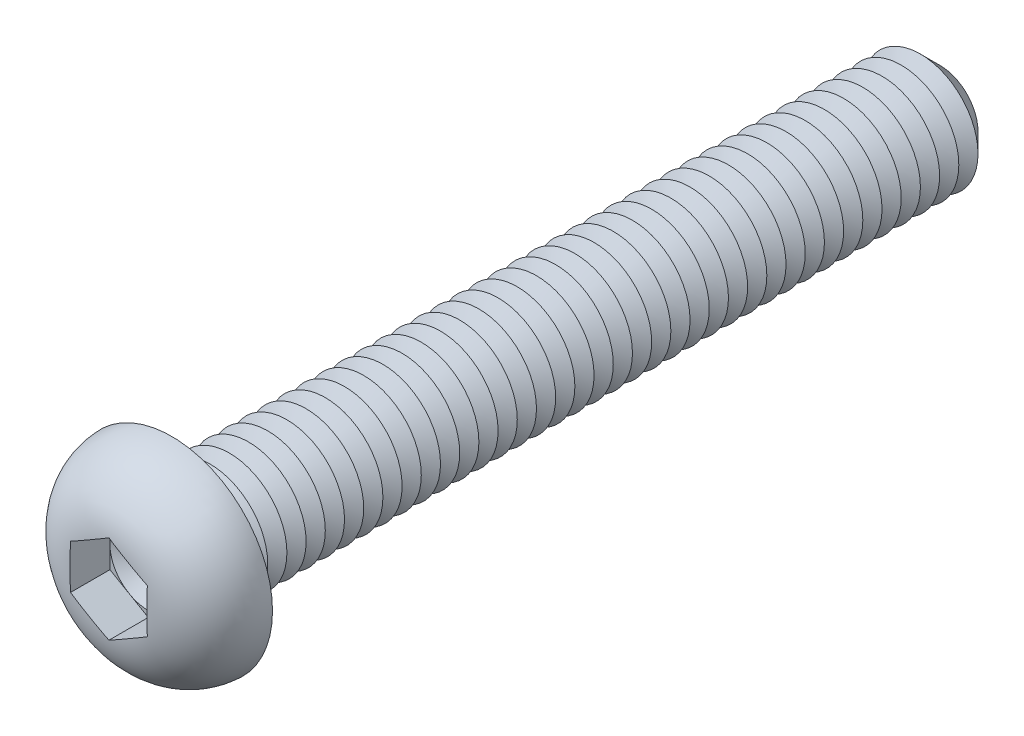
ISO-10303-21;
HEADER;
FILE_DESCRIPTION(('STEP AP214'),'2;1');
FILE_NAME('part.step','',(''),(''),'','','');
FILE_SCHEMA(('AUTOMOTIVE_DESIGN { 1 0 10303 214 1 1 1 1 }'));
ENDSEC;
DATA;
#1=APPLICATION_CONTEXT('core data for automotive mechanical design processes');
#2=APPLICATION_PROTOCOL_DEFINITION('international standard','automotive_design',2000,#1);
#3=PRODUCT_CONTEXT('',#1,'mechanical');
#4=PRODUCT('Part','Part','',(#3));
#5=PRODUCT_RELATED_PRODUCT_CATEGORY('part','',(#4));
#6=PRODUCT_DEFINITION_FORMATION('','',#4);
#7=PRODUCT_DEFINITION_CONTEXT('part definition',#1,'design');
#8=PRODUCT_DEFINITION('design','',#6,#7);
#9=PRODUCT_DEFINITION_SHAPE('','',#8);
#10=(LENGTH_UNIT() NAMED_UNIT(*) SI_UNIT(.MILLI.,.METRE.));
#11=(NAMED_UNIT(*) PLANE_ANGLE_UNIT() SI_UNIT($,.RADIAN.));
#12=(NAMED_UNIT(*) SI_UNIT($,.STERADIAN.) SOLID_ANGLE_UNIT());
#13=UNCERTAINTY_MEASURE_WITH_UNIT(LENGTH_MEASURE(1.E-05),#10,'distance_accuracy_value','');
#14=(GEOMETRIC_REPRESENTATION_CONTEXT(3) GLOBAL_UNCERTAINTY_ASSIGNED_CONTEXT((#13)) GLOBAL_UNIT_ASSIGNED_CONTEXT((#10,
#11,#12)) REPRESENTATION_CONTEXT('',''));
#15=CARTESIAN_POINT('',(0.,0.,0.));
#16=DIRECTION('',(0.,0.,1.));
#17=DIRECTION('',(1.,0.,0.));
#18=AXIS2_PLACEMENT_3D('',#15,#16,#17);
#19=CARTESIAN_POINT('',(0.,0.,1.22));
#20=DIRECTION('',(0.,0.,1.));
#21=DIRECTION('',(1.,0.,0.));
#22=AXIS2_PLACEMENT_3D('',#19,#20,#21);
#23=PLANE('',#22);
#24=CARTESIAN_POINT('',(0.,0.,1.22));
#25=DIRECTION('',(0.,0.,1.));
#26=DIRECTION('',(1.,0.,0.));
#27=AXIS2_PLACEMENT_3D('',#24,#25,#26);
#28=CIRCLE('',#27,2.);
#29=CARTESIAN_POINT('',(2.,0.,1.22));
#30=VERTEX_POINT('',#29);
#31=CARTESIAN_POINT('',(1.,1.73205080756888,1.22));
#32=VERTEX_POINT('',#31);
#33=EDGE_CURVE('E117',#30,#32,#28,.T.);
#34=ORIENTED_EDGE('',*,*,#33,.F.);
#35=DIRECTION('',(0.,1.,0.));
#36=VECTOR('',#35,1.);
#37=CARTESIAN_POINT('',(2.,-1.15470053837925,1.22));
#38=LINE('',#37,#36);
#39=CARTESIAN_POINT('',(2.,1.15470053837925,1.22));
#40=VERTEX_POINT('',#39);
#41=EDGE_CURVE('E140',#30,#40,#38,.T.);
#42=ORIENTED_EDGE('',*,*,#41,.T.);
#43=DIRECTION('',(-0.866025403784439,0.5,0.));
#44=VECTOR('',#43,1.);
#45=CARTESIAN_POINT('',(2.,1.15470053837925,1.22));
#46=LINE('',#45,#44);
#47=EDGE_CURVE('E136',#40,#32,#46,.T.);
#48=ORIENTED_EDGE('',*,*,#47,.T.);
#49=EDGE_LOOP('',(#34,#42,#48));
#50=FACE_BOUND('',#49,.T.);
#51=ADVANCED_FACE('F39',(#50),#23,.T.);
#52=CARTESIAN_POINT('',(0.,0.,1.22));
#53=DIRECTION('',(0.,0.,1.));
#54=DIRECTION('',(1.,0.,0.));
#55=AXIS2_PLACEMENT_3D('',#52,#53,#54);
#56=CIRCLE('',#55,2.);
#57=CARTESIAN_POINT('',(-1.,1.73205080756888,1.22));
#58=VERTEX_POINT('',#57);
#59=EDGE_CURVE('E11',#32,#58,#56,.T.);
#60=ORIENTED_EDGE('',*,*,#59,.F.);
#61=CARTESIAN_POINT('',(0.,2.3094010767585,1.22));
#62=VERTEX_POINT('',#61);
#63=EDGE_CURVE('E130',#32,#62,#46,.T.);
#64=ORIENTED_EDGE('',*,*,#63,.T.);
#65=DIRECTION('',(-0.866025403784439,-0.5,0.));
#66=VECTOR('',#65,1.);
#67=CARTESIAN_POINT('',(0.,2.3094010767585,1.22));
#68=LINE('',#67,#66);
#69=EDGE_CURVE('E131',#62,#58,#68,.T.);
#70=ORIENTED_EDGE('',*,*,#69,.T.);
#71=EDGE_LOOP('',(#60,#64,#70));
#72=FACE_BOUND('',#71,.T.);
#73=ADVANCED_FACE('F129',(#72),#23,.T.);
#74=CARTESIAN_POINT('',(-2.,0.,1.22));
#75=VERTEX_POINT('',#74);
#76=EDGE_CURVE('E49',#58,#75,#56,.T.);
#77=ORIENTED_EDGE('',*,*,#76,.F.);
#78=CARTESIAN_POINT('',(-2.,1.15470053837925,1.22));
#79=VERTEX_POINT('',#78);
#80=EDGE_CURVE('E143',#58,#79,#68,.T.);
#81=ORIENTED_EDGE('',*,*,#80,.T.);
#82=DIRECTION('',(0.,-1.,0.));
#83=VECTOR('',#82,1.);
#84=CARTESIAN_POINT('',(-2.,1.15470053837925,1.22));
#85=LINE('',#84,#83);
#86=EDGE_CURVE('E153',#79,#75,#85,.T.);
#87=ORIENTED_EDGE('',*,*,#86,.T.);
#88=EDGE_LOOP('',(#77,#81,#87));
#89=FACE_BOUND('',#88,.T.);
#90=ADVANCED_FACE('F273',(#89),#23,.T.);
#91=CARTESIAN_POINT('',(-1.,-1.73205080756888,1.22));
#92=VERTEX_POINT('',#91);
#93=EDGE_CURVE('E254',#75,#92,#56,.T.);
#94=ORIENTED_EDGE('',*,*,#93,.F.);
#95=CARTESIAN_POINT('',(-2.,-1.15470053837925,1.22));
#96=VERTEX_POINT('',#95);
#97=EDGE_CURVE('E152',#75,#96,#85,.T.);
#98=ORIENTED_EDGE('',*,*,#97,.T.);
#99=DIRECTION('',(0.866025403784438,-0.5,0.));
#100=VECTOR('',#99,1.);
#101=CARTESIAN_POINT('',(-2.,-1.15470053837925,1.22));
#102=LINE('',#101,#100);
#103=EDGE_CURVE('E158',#96,#92,#102,.T.);
#104=ORIENTED_EDGE('',*,*,#103,.T.);
#105=EDGE_LOOP('',(#94,#98,#104));
#106=FACE_BOUND('',#105,.T.);
#107=ADVANCED_FACE('F267',(#106),#23,.T.);
#108=CARTESIAN_POINT('',(0.999999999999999,-1.73205080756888,1.22));
#109=VERTEX_POINT('',#108);
#110=EDGE_CURVE('E56',#92,#109,#56,.T.);
#111=ORIENTED_EDGE('',*,*,#110,.F.);
#112=CARTESIAN_POINT('',(0.,-2.3094010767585,1.22));
#113=VERTEX_POINT('',#112);
#114=EDGE_CURVE('E157',#92,#113,#102,.T.);
#115=ORIENTED_EDGE('',*,*,#114,.T.);
#116=DIRECTION('',(0.866025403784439,0.5,0.));
#117=VECTOR('',#116,1.);
#118=CARTESIAN_POINT('',(0.,-2.3094010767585,1.22));
#119=LINE('',#118,#117);
#120=EDGE_CURVE('E162',#113,#109,#119,.T.);
#121=ORIENTED_EDGE('',*,*,#120,.T.);
#122=EDGE_LOOP('',(#111,#115,#121));
#123=FACE_BOUND('',#122,.T.);
#124=ADVANCED_FACE('F308',(#123),#23,.T.);
#125=CARTESIAN_POINT('',(0.,0.,-40.));
#126=DIRECTION('',(0.,0.,1.));
#127=DIRECTION('',(1.,0.,0.));
#128=AXIS2_PLACEMENT_3D('',#125,#126,#127);
#129=CYLINDRICAL_SURFACE('',#128,3.);
#130=CARTESIAN_POINT('',(0.,0.,-0.5));
#131=DIRECTION('',(0.,0.,1.));
#132=DIRECTION('',(1.,0.,0.));
#133=AXIS2_PLACEMENT_3D('',#130,#131,#132);
#134=CIRCLE('',#133,3.);
#135=CARTESIAN_POINT('',(3.,0.,-0.5));
#136=VERTEX_POINT('',#135);
#137=EDGE_CURVE('E241',#136,#136,#134,.F.);
#138=ORIENTED_EDGE('',*,*,#137,.T.);
#139=EDGE_LOOP('',(#138));
#140=FACE_BOUND('',#139,.T.);
#141=CARTESIAN_POINT('',(0.,0.,-1.));
#142=DIRECTION('',(0.,0.,1.));
#143=DIRECTION('',(1.,0.,0.));
#144=AXIS2_PLACEMENT_3D('',#141,#142,#143);
#145=CIRCLE('',#144,3.00000000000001);
#146=CARTESIAN_POINT('',(3.00000000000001,0.,-1.));
#147=VERTEX_POINT('',#146);
#148=EDGE_CURVE('E138',#147,#147,#145,.T.);
#149=ORIENTED_EDGE('',*,*,#148,.T.);
#150=EDGE_LOOP('',(#149));
#151=FACE_BOUND('',#150,.T.);
#152=ADVANCED_FACE('F309',(#140,#151),#129,.T.);
#153=CARTESIAN_POINT('',(0.,5.25,0.));
#154=DIRECTION('',(0.,0.,1.));
#155=DIRECTION('',(1.,0.,0.));
#156=AXIS2_PLACEMENT_3D('',#153,#154,#155);
#157=PLANE('',#156);
#158=CARTESIAN_POINT('',(0.,0.,0.));
#159=DIRECTION('',(0.,0.,1.));
#160=DIRECTION('',(1.,0.,0.));
#161=AXIS2_PLACEMENT_3D('',#158,#159,#160);
#162=CIRCLE('',#161,3.5);
#163=CARTESIAN_POINT('',(3.5,0.,0.));
#164=VERTEX_POINT('',#163);
#165=EDGE_CURVE('E244',#164,#164,#162,.T.);
#166=ORIENTED_EDGE('',*,*,#165,.T.);
#167=EDGE_LOOP('',(#166));
#168=FACE_BOUND('',#167,.T.);
#169=CARTESIAN_POINT('',(0.,0.,0.));
#170=DIRECTION('',(0.,0.,1.));
#171=DIRECTION('',(1.,0.,0.));
#172=AXIS2_PLACEMENT_3D('',#169,#170,#171);
#173=CIRCLE('',#172,5.25);
#174=CARTESIAN_POINT('',(5.25,0.,0.));
#175=VERTEX_POINT('',#174);
#176=EDGE_CURVE('E173',#175,#175,#173,.T.);
#177=ORIENTED_EDGE('',*,*,#176,.F.);
#178=EDGE_LOOP('',(#177));
#179=FACE_BOUND('',#178,.T.);
#180=ADVANCED_FACE('F312',(#168,#179),#157,.F.);
#181=CARTESIAN_POINT('',(0.,0.,-0.0999999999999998));
#182=DIRECTION('',(0.,0.,1.));
#183=DIRECTION('',(1.,0.,0.));
#184=AXIS2_PLACEMENT_3D('',#181,#182,#183);
#185=DEGENERATE_TOROIDAL_SURFACE('',#184,1.85147090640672,3.4,.T.);
#186=CARTESIAN_POINT('',(-2.0002,1.15458506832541,3.26900492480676));
#187=CARTESIAN_POINT('',(-1.91694658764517,1.20265144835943,3.27552708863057));
#188=CARTESIAN_POINT('',(-1.83362001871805,1.25076006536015,3.28041849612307));
#189=CARTESIAN_POINT('',(-1.66691146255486,1.34700929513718,3.28784569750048));
#190=CARTESIAN_POINT('',(-1.58352950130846,1.39514989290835,3.29038223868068));
#191=CARTESIAN_POINT('',(-1.4167967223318,1.49141310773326,3.29400753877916));
#192=CARTESIAN_POINT('',(-1.33344591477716,1.5395357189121,3.29509714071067));
#193=CARTESIAN_POINT('',(-1.16673007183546,1.63578915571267,3.29647051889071));
#194=CARTESIAN_POINT('',(-1.08336503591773,1.68391998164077,3.29675420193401));
#195=CARTESIAN_POINT('',(-0.916634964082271,1.78018163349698,3.29675420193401));
#196=CARTESIAN_POINT('',(-0.833269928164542,1.82831245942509,3.29647051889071));
#197=CARTESIAN_POINT('',(-0.666554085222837,1.92456589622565,3.29509714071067));
#198=CARTESIAN_POINT('',(-0.583203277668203,1.9726885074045,3.29400753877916));
#199=CARTESIAN_POINT('',(-0.416470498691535,2.06895172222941,3.29038223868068));
#200=CARTESIAN_POINT('',(-0.333088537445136,2.11709232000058,3.28784569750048));
#201=CARTESIAN_POINT('',(-0.166379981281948,2.21334154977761,3.28041849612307));
#202=CARTESIAN_POINT('',(-0.0830534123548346,2.26145016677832,3.27552708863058));
#203=CARTESIAN_POINT('',(0.000200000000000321,2.30951654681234,3.26900492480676));
#204=B_SPLINE_CURVE_WITH_KNOTS('',3,(#186,#187,#188,#189,#190,#191,#192,#193,#194,#195,#196,
#197,#198,#199,#200,#201,#202,#203),.UNSPECIFIED.,.F.,.F.,(4,2,2,2,2,2,2,2,4),(0.,
0.289010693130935,0.57792963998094,0.866680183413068,1.15546411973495,1.44424805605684,
1.73299859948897,2.02191754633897,2.31092823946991),.UNSPECIFIED.);
#205=CARTESIAN_POINT('',(-2.,1.15470053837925,3.26902062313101));
#206=VERTEX_POINT('',#205);
#207=CARTESIAN_POINT('',(1.70733705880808E-11,2.30940107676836,3.2690206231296));
#208=VERTEX_POINT('',#207);
#209=EDGE_CURVE('E195',#206,#208,#204,.T.);
#210=ORIENTED_EDGE('',*,*,#209,.T.);
#211=CARTESIAN_POINT('',(-0.000199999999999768,2.30951654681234,3.26900492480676));
#212=CARTESIAN_POINT('',(0.0830534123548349,2.26145016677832,3.27552708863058));
#213=CARTESIAN_POINT('',(0.166379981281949,2.21334154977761,3.28041849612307));
#214=CARTESIAN_POINT('',(0.333088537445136,2.11709232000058,3.28784569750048));
#215=CARTESIAN_POINT('',(0.416470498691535,2.06895172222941,3.29038223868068));
#216=CARTESIAN_POINT('',(0.583203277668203,1.9726885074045,3.29400753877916));
#217=CARTESIAN_POINT('',(0.666554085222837,1.92456589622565,3.29509714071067));
#218=CARTESIAN_POINT('',(0.833269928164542,1.82831245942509,3.29647051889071));
#219=CARTESIAN_POINT('',(0.916634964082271,1.78018163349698,3.29675420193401));
#220=CARTESIAN_POINT('',(1.08336503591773,1.68391998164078,3.29675420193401));
#221=CARTESIAN_POINT('',(1.16673007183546,1.63578915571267,3.29647051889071));
#222=CARTESIAN_POINT('',(1.33344591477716,1.5395357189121,3.29509714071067));
#223=CARTESIAN_POINT('',(1.4167967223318,1.49141310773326,3.29400753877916));
#224=CARTESIAN_POINT('',(1.58352950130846,1.39514989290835,3.29038223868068));
#225=CARTESIAN_POINT('',(1.66691146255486,1.34700929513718,3.28784569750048));
#226=CARTESIAN_POINT('',(1.83362001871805,1.25076006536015,3.28041849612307));
#227=CARTESIAN_POINT('',(1.91694658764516,1.20265144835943,3.27552708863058));
#228=CARTESIAN_POINT('',(2.0002,1.15458506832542,3.26900492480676));
#229=B_SPLINE_CURVE_WITH_KNOTS('',3,(#211,#212,#213,#214,#215,#216,#217,#218,#219,#220,#221,
#222,#223,#224,#225,#226,#227,#228),.UNSPECIFIED.,.F.,.F.,(4,2,2,2,2,2,2,2,4),(0.,
0.289010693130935,0.577929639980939,0.866680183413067,1.15546411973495,1.44424805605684,
1.73299859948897,2.02191754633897,2.31092823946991),.UNSPECIFIED.);
#230=CARTESIAN_POINT('',(2.,1.15470053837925,3.26902062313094));
#231=VERTEX_POINT('',#230);
#232=EDGE_CURVE('E224',#208,#231,#229,.T.);
#233=ORIENTED_EDGE('',*,*,#232,.T.);
#234=CARTESIAN_POINT('',(2.,0.,3.29675420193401));
#235=CARTESIAN_POINT('',(2.,-0.0838690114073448,3.29675159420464));
#236=CARTESIAN_POINT('',(2.,-0.167737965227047,3.29653427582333));
#237=CARTESIAN_POINT('',(2.,-0.335473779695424,3.29552217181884));
#238=CARTESIAN_POINT('',(2.,-0.419340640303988,3.29472737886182));
#239=CARTESIAN_POINT('',(2.,-0.587092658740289,3.29218243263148));
#240=CARTESIAN_POINT('',(2.,-0.670977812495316,3.29043194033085));
#241=CARTESIAN_POINT('',(2.,-0.838702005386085,3.28542814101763));
#242=CARTESIAN_POINT('',(2.,-0.922541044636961,3.28217483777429));
#243=CARTESIAN_POINT('',(2.,-1.173343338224,3.26923984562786));
#244=CARTESIAN_POINT('',(2.,-1.34017699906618,3.25638268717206));
#245=CARTESIAN_POINT('',(2.,-1.67225876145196,3.21731215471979));
#246=CARTESIAN_POINT('',(2.,-1.83750825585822,3.19111187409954));
#247=CARTESIAN_POINT('',(2.,-2.10571503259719,3.13417573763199));
#248=CARTESIAN_POINT('',(2.,-2.20973442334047,3.10844622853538));
#249=CARTESIAN_POINT('',(2.,-2.41562153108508,3.04936015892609));
#250=CARTESIAN_POINT('',(2.,-2.51748898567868,3.01600267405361));
#251=CARTESIAN_POINT('',(2.,-2.71832295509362,2.94120377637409));
#252=CARTESIAN_POINT('',(2.,-2.81728700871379,2.89975572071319));
#253=CARTESIAN_POINT('',(2.,-3.01134256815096,2.80859624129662));
#254=CARTESIAN_POINT('',(2.,-3.10643425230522,2.75888519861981));
#255=CARTESIAN_POINT('',(2.,-3.29253530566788,2.65079509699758));
#256=CARTESIAN_POINT('',(2.,-3.38350832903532,2.59235327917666));
#257=CARTESIAN_POINT('',(2.,-3.55964478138,2.46728791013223));
#258=CARTESIAN_POINT('',(2.,-3.64480873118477,2.40066509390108));
#259=CARTESIAN_POINT('',(2.,-3.80840353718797,2.25961603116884));
#260=CARTESIAN_POINT('',(2.,-3.88683504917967,2.18519054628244));
#261=CARTESIAN_POINT('',(2.,-4.03608847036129,2.02906828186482));
#262=CARTESIAN_POINT('',(2.,-4.106911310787,1.94737239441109));
#263=CARTESIAN_POINT('',(2.,-4.23287471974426,1.78665318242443));
#264=CARTESIAN_POINT('',(2.,-4.2888832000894,1.7083085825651));
#265=CARTESIAN_POINT('',(2.,-4.39372062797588,1.54691061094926));
#266=CARTESIAN_POINT('',(2.,-4.44254705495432,1.46385560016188));
#267=CARTESIAN_POINT('',(2.,-4.53249771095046,1.29375158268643));
#268=CARTESIAN_POINT('',(2.,-4.57362814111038,1.20670586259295));
#269=CARTESIAN_POINT('',(2.,-4.6478549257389,1.02924414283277));
#270=CARTESIAN_POINT('',(2.,-4.68094842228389,0.938826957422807));
#271=CARTESIAN_POINT('',(2.,-4.76413649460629,0.674747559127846));
#272=CARTESIAN_POINT('',(2.,-4.80368573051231,0.497625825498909));
#273=CARTESIAN_POINT('',(2.,-4.85179982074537,0.13932226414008));
#274=CARTESIAN_POINT('',(2.,-4.86036774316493,-0.0418591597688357));
#275=CARTESIAN_POINT('',(2.,-4.84642577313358,-0.399473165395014));
#276=CARTESIAN_POINT('',(2.,-4.82452156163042,-0.575929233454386));
#277=CARTESIAN_POINT('',(2.,-4.75142809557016,-0.922615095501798));
#278=CARTESIAN_POINT('',(2.,-4.70024536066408,-1.09284626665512));
#279=CARTESIAN_POINT('',(2.,-4.57020203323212,-1.42258491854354));
#280=CARTESIAN_POINT('',(2.,-4.49131097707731,-1.58208036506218));
#281=CARTESIAN_POINT('',(2.,-4.3083542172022,-1.8860021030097));
#282=CARTESIAN_POINT('',(2.,-4.2042742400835,-2.03041978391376));
#283=CARTESIAN_POINT('',(2.,-3.97174533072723,-2.30354399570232));
#284=CARTESIAN_POINT('',(2.,-3.84281347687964,-2.43183812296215));
#285=CARTESIAN_POINT('',(2.,-3.56631740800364,-2.66612298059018));
#286=CARTESIAN_POINT('',(2.,-3.41877418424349,-2.77213848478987));
#287=CARTESIAN_POINT('',(2.,-3.18261597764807,-2.91604941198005));
#288=CARTESIAN_POINT('',(2.,-3.09905663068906,-2.96247915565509));
#289=CARTESIAN_POINT('',(2.,-2.92856838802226,-3.04879370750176));
#290=CARTESIAN_POINT('',(2.,-2.84163827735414,-3.08867612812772));
#291=CARTESIAN_POINT('',(2.,-2.66495003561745,-3.16199567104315));
#292=CARTESIAN_POINT('',(2.,-2.57518752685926,-3.19542218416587));
#293=CARTESIAN_POINT('',(2.,-2.3936698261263,-3.25594506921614));
#294=CARTESIAN_POINT('',(2.,-2.30191676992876,-3.28304789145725));
#295=CARTESIAN_POINT('',(2.,-2.07265810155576,-3.34285611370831));
#296=CARTESIAN_POINT('',(2.,-1.93423373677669,-3.37205334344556));
#297=CARTESIAN_POINT('',(2.,-1.65546420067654,-3.419280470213));
#298=CARTESIAN_POINT('',(2.,-1.51511762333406,-3.43730169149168));
#299=CARTESIAN_POINT('',(2.,-1.23291689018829,-3.46473877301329));
#300=CARTESIAN_POINT('',(2.,-1.09105869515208,-3.47411015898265));
#301=CARTESIAN_POINT('',(2.,-0.807138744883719,-3.48717303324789));
#302=CARTESIAN_POINT('',(2.,-0.665077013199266,-3.4908651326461));
#303=CARTESIAN_POINT('',(2.,-0.451303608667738,-3.49429675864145));
#304=CARTESIAN_POINT('',(2.,-0.379602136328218,-3.49508825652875));
#305=CARTESIAN_POINT('',(2.,-0.236195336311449,-3.49619580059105));
#306=CARTESIAN_POINT('',(2.,-0.164490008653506,-3.49651184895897));
#307=CARTESIAN_POINT('',(2.,-0.0210718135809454,-3.49680708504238));
#308=CARTESIAN_POINT('',(2.,0.0506410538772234,-3.49678623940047));
#309=CARTESIAN_POINT('',(2.,0.194065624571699,-3.49639104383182));
#310=CARTESIAN_POINT('',(2.,0.265777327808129,-3.49601669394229));
#311=CARTESIAN_POINT('',(2.,0.480501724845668,-3.4941697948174));
#312=CARTESIAN_POINT('',(2.,0.623510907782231,-3.49197539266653));
#313=CARTESIAN_POINT('',(2.,0.909378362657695,-3.48318258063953));
#314=CARTESIAN_POINT('',(2.,1.05223667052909,-3.47658576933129));
#315=CARTESIAN_POINT('',(2.,1.30726724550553,-3.45800282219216));
#316=CARTESIAN_POINT('',(2.,1.41953767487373,-3.44745204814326));
#317=CARTESIAN_POINT('',(2.,1.64336701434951,-3.42020385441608));
#318=CARTESIAN_POINT('',(2.,1.75492585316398,-3.40350582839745));
#319=CARTESIAN_POINT('',(2.,1.97590795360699,-3.36293007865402));
#320=CARTESIAN_POINT('',(2.,2.08534088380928,-3.33910600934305));
#321=CARTESIAN_POINT('',(2.,2.30216001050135,-3.28336687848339));
#322=CARTESIAN_POINT('',(2.,2.40954602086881,-3.25145108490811));
#323=CARTESIAN_POINT('',(2.,2.62289868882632,-3.1784271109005));
#324=CARTESIAN_POINT('',(2.,2.72882262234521,-3.13719314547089));
#325=CARTESIAN_POINT('',(2.,2.93660837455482,-3.04548652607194));
#326=CARTESIAN_POINT('',(2.,3.03847031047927,-2.99501413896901));
#327=CARTESIAN_POINT('',(2.,3.23738754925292,-2.88459171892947));
#328=CARTESIAN_POINT('',(2.,3.33442546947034,-2.82461027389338));
#329=CARTESIAN_POINT('',(2.,3.52225616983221,-2.69545434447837));
#330=CARTESIAN_POINT('',(2.,3.61304636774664,-2.62627609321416));
#331=CARTESIAN_POINT('',(2.,3.77958578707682,-2.48563135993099));
#332=CARTESIAN_POINT('',(2.,3.85595570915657,-2.41489922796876));
#333=CARTESIAN_POINT('',(2.,4.00175744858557,-2.26661746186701));
#334=CARTESIAN_POINT('',(2.,4.07118992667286,-2.18906847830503));
#335=CARTESIAN_POINT('',(2.,4.20228235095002,-2.02784942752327));
#336=CARTESIAN_POINT('',(2.,4.26395450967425,-1.94418931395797));
#337=CARTESIAN_POINT('',(2.,4.37897455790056,-1.7713710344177));
#338=CARTESIAN_POINT('',(2.,4.43232318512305,-1.68221335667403));
#339=CARTESIAN_POINT('',(2.,4.5685109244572,-1.42722170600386));
#340=CARTESIAN_POINT('',(2.,4.64167742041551,-1.25607726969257));
#341=CARTESIAN_POINT('',(2.,4.75695354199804,-0.903699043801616));
#342=CARTESIAN_POINT('',(2.,4.79906366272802,-0.722465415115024));
#343=CARTESIAN_POINT('',(2.,4.84982785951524,-0.362243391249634));
#344=CARTESIAN_POINT('',(2.,4.85966759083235,-0.183422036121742));
#345=CARTESIAN_POINT('',(2.,4.84889099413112,0.17327689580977));
#346=CARTESIAN_POINT('',(2.,4.82827907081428,0.351154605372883));
#347=CARTESIAN_POINT('',(2.,4.75760776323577,0.699332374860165));
#348=CARTESIAN_POINT('',(2.,4.70780624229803,0.869684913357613));
#349=CARTESIAN_POINT('',(2.,4.58058971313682,1.199716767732));
#350=CARTESIAN_POINT('',(2.,4.50317623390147,1.35939667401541));
#351=CARTESIAN_POINT('',(2.,4.32230037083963,1.66542907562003));
#352=CARTESIAN_POINT('',(2.,4.21858077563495,1.81162931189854));
#353=CARTESIAN_POINT('',(2.,3.98879583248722,2.08527000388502));
#354=CARTESIAN_POINT('',(2.,3.86272429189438,2.21270524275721));
#355=CARTESIAN_POINT('',(2.,3.58743550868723,2.45020985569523));
#356=CARTESIAN_POINT('',(2.,3.43756474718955,2.55951924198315));
#357=CARTESIAN_POINT('',(2.,3.12282273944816,2.7535430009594));
#358=CARTESIAN_POINT('',(2.,2.95795742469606,2.83826704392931));
#359=CARTESIAN_POINT('',(2.,2.67096435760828,2.96064273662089));
#360=CARTESIAN_POINT('',(2.,2.55150855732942,3.00473766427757));
#361=CARTESIAN_POINT('',(2.,2.30905936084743,3.08191633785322));
#362=CARTESIAN_POINT('',(2.,2.18606487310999,3.11499664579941));
#363=CARTESIAN_POINT('',(2.,1.93761764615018,3.17114962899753));
#364=CARTESIAN_POINT('',(2.,1.8121607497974,3.19420352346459));
#365=CARTESIAN_POINT('',(2.,1.56000755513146,3.23170431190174));
#366=CARTESIAN_POINT('',(2.,1.43331126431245,3.24615125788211));
#367=CARTESIAN_POINT('',(2.,1.19785080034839,3.26676473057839));
#368=CARTESIAN_POINT('',(2.,1.08915974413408,3.27383022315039));
#369=CARTESIAN_POINT('',(2.,0.87159878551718,3.28448481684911));
#370=CARTESIAN_POINT('',(2.,0.762728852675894,3.28807324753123));
#371=CARTESIAN_POINT('',(2.,0.54488171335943,3.29312180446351));
#372=CARTESIAN_POINT('',(2.,0.435904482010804,3.29458062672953));
#373=CARTESIAN_POINT('',(2.,0.217951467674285,3.29639847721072));
#374=CARTESIAN_POINT('',(2.,0.108975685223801,3.29675759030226));
#375=CARTESIAN_POINT('',(2.,0.,3.29675420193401));
#376=B_SPLINE_CURVE_WITH_KNOTS('',3,(#234,#235,#236,#237,#238,#239,#240,#241,#242,#243,#244,
#245,#246,#247,#248,#249,#250,#251,#252,#253,#254,#255,#256,#257,#258,#259,#260,#261,#262,#263,
#264,#265,#266,#267,#268,#269,#270,#271,#272,#273,#274,#275,#276,#277,#278,#279,#280,#281,#282,
#283,#284,#285,#286,#287,#288,#289,#290,#291,#292,#293,#294,#295,#296,#297,#298,#299,#300,#301,
#302,#303,#304,#305,#306,#307,#308,#309,#310,#311,#312,#313,#314,#315,#316,#317,#318,#319,#320,
#321,#322,#323,#324,#325,#326,#327,#328,#329,#330,#331,#332,#333,#334,#335,#336,#337,#338,#339,
#340,#341,#342,#343,#344,#345,#346,#347,#348,#349,#350,#351,#352,#353,#354,#355,#356,#357,#358,
#359,#360,#361,#362,#363,#364,#365,#366,#367,#368,#369,#370,#371,#372,#373,#374,#375),
.UNSPECIFIED.,.T.,.F.,(4,2,2,2,2,2,2,2,2,2,2,2,2,2,2,2,2,2,2,2,2,2,2,2,2,2,2,2,2,2,2,2,2,2,2,2,
2,2,2,2,2,2,2,2,2,2,2,2,2,2,2,2,2,2,2,2,2,2,2,2,2,2,2,2,2,2,2,2,2,2,4),(0.,0.251606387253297,
0.503215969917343,0.754914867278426,1.00661313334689,1.50825543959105,2.00940643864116,
2.33061510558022,2.65186271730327,2.97337521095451,3.29487288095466,3.61880390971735,
3.94270585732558,4.26657621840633,4.59040689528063,4.8789527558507,5.16759964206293,
5.45601293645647,5.74452864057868,6.28608750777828,6.82759274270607,7.35848716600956,
7.8892634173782,8.42062506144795,8.95228851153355,9.49557283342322,10.0382497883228,
10.3247866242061,10.6114277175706,10.8985359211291,11.1853499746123,11.6091713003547,
12.0333212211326,12.4596400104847,12.8859129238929,13.1010304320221,13.316146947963,
13.5312847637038,13.746422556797,14.1754765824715,14.6043748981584,14.9425387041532,
15.2807358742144,15.6164481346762,15.9521907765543,16.2927694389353,16.6333382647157,
16.9750565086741,17.3169151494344,17.6287548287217,17.9405647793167,18.2518777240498,
18.5631630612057,19.1185081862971,19.6738444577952,20.20853386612,20.7431459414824,
21.2731049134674,21.8030345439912,22.3383600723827,22.8738341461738,23.4279697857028,
23.9818871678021,24.3633752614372,24.7449823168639,25.1273011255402,25.5096176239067,
25.8363061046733,26.163057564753,26.4900090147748,26.8169352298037),.UNSPECIFIED.);
#377=CARTESIAN_POINT('',(2.,-1.15470053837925,3.26902062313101));
#378=VERTEX_POINT('',#377);
#379=EDGE_CURVE('E233',#231,#378,#376,.T.);
#380=ORIENTED_EDGE('',*,*,#379,.T.);
#381=CARTESIAN_POINT('',(2.0002,-1.15458506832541,3.26900492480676));
#382=CARTESIAN_POINT('',(1.91694658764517,-1.20265144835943,3.27552708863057));
#383=CARTESIAN_POINT('',(1.83362001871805,-1.25076006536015,3.28041849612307));
#384=CARTESIAN_POINT('',(1.66691146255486,-1.34700929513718,3.28784569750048));
#385=CARTESIAN_POINT('',(1.58352950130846,-1.39514989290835,3.29038223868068));
#386=CARTESIAN_POINT('',(1.4167967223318,-1.49141310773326,3.29400753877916));
#387=CARTESIAN_POINT('',(1.33344591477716,-1.5395357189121,3.29509714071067));
#388=CARTESIAN_POINT('',(1.16673007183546,-1.63578915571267,3.29647051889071));
#389=CARTESIAN_POINT('',(1.08336503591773,-1.68391998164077,3.29675420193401));
#390=CARTESIAN_POINT('',(0.916634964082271,-1.78018163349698,3.29675420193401));
#391=CARTESIAN_POINT('',(0.833269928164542,-1.82831245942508,3.29647051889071));
#392=CARTESIAN_POINT('',(0.666554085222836,-1.92456589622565,3.29509714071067));
#393=CARTESIAN_POINT('',(0.583203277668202,-1.97268850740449,3.29400753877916));
#394=CARTESIAN_POINT('',(0.416470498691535,-2.06895172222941,3.29038223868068));
#395=CARTESIAN_POINT('',(0.333088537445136,-2.11709232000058,3.28784569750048));
#396=CARTESIAN_POINT('',(0.166379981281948,-2.2133415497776,3.28041849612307));
#397=CARTESIAN_POINT('',(0.0830534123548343,-2.26145016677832,3.27552708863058));
#398=CARTESIAN_POINT('',(-0.000200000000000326,-2.30951654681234,3.26900492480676));
#399=B_SPLINE_CURVE_WITH_KNOTS('',3,(#381,#382,#383,#384,#385,#386,#387,#388,#389,#390,#391,
#392,#393,#394,#395,#396,#397,#398),.UNSPECIFIED.,.F.,.F.,(4,2,2,2,2,2,2,2,4),(0.,
0.289010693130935,0.57792963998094,0.866680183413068,1.15546411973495,1.44424805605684,
1.73299859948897,2.02191754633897,2.31092823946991),.UNSPECIFIED.);
#400=CARTESIAN_POINT('',(0.,-2.3094010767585,3.26902062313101));
#401=VERTEX_POINT('',#400);
#402=EDGE_CURVE('E283',#378,#401,#399,.T.);
#403=ORIENTED_EDGE('',*,*,#402,.T.);
#404=CARTESIAN_POINT('',(0.000199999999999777,-2.30951654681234,3.26900492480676));
#405=CARTESIAN_POINT('',(-0.083053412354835,-2.26145016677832,3.27552708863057));
#406=CARTESIAN_POINT('',(-0.166379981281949,-2.21334154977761,3.28041849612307));
#407=CARTESIAN_POINT('',(-0.333088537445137,-2.11709232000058,3.28784569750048));
#408=CARTESIAN_POINT('',(-0.416470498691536,-2.06895172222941,3.29038223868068));
#409=CARTESIAN_POINT('',(-0.583203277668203,-1.97268850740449,3.29400753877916));
#410=CARTESIAN_POINT('',(-0.666554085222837,-1.92456589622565,3.29509714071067));
#411=CARTESIAN_POINT('',(-0.833269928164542,-1.82831245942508,3.29647051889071));
#412=CARTESIAN_POINT('',(-0.916634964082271,-1.78018163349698,3.29675420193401));
#413=CARTESIAN_POINT('',(-1.08336503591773,-1.68391998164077,3.29675420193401));
#414=CARTESIAN_POINT('',(-1.16673007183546,-1.63578915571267,3.29647051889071));
#415=CARTESIAN_POINT('',(-1.33344591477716,-1.5395357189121,3.29509714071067));
#416=CARTESIAN_POINT('',(-1.4167967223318,-1.49141310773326,3.29400753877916));
#417=CARTESIAN_POINT('',(-1.58352950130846,-1.39514989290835,3.29038223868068));
#418=CARTESIAN_POINT('',(-1.66691146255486,-1.34700929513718,3.28784569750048));
#419=CARTESIAN_POINT('',(-1.83362001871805,-1.25076006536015,3.28041849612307));
#420=CARTESIAN_POINT('',(-1.91694658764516,-1.20265144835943,3.27552708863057));
#421=CARTESIAN_POINT('',(-2.0002,-1.15458506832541,3.26900492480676));
#422=B_SPLINE_CURVE_WITH_KNOTS('',3,(#404,#405,#406,#407,#408,#409,#410,#411,#412,#413,#414,
#415,#416,#417,#418,#419,#420,#421),.UNSPECIFIED.,.F.,.F.,(4,2,2,2,2,2,2,2,4),(0.,
0.289010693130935,0.577929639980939,0.866680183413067,1.15546411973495,1.44424805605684,
1.73299859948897,2.02191754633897,2.31092823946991),.UNSPECIFIED.);
#423=CARTESIAN_POINT('',(-2.,-1.15470053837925,3.26902062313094));
#424=VERTEX_POINT('',#423);
#425=EDGE_CURVE('E280',#401,#424,#422,.T.);
#426=ORIENTED_EDGE('',*,*,#425,.T.);
#427=CARTESIAN_POINT('',(-2.,0.,3.29675420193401));
#428=CARTESIAN_POINT('',(-2.,0.0838690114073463,3.29675159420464));
#429=CARTESIAN_POINT('',(-2.,0.167737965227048,3.29653427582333));
#430=CARTESIAN_POINT('',(-2.,0.335473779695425,3.29552217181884));
#431=CARTESIAN_POINT('',(-2.,0.41934064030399,3.29472737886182));
#432=CARTESIAN_POINT('',(-2.,0.58709265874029,3.29218243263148));
#433=CARTESIAN_POINT('',(-2.,0.670977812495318,3.29043194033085));
#434=CARTESIAN_POINT('',(-2.,0.838702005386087,3.28542814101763));
#435=CARTESIAN_POINT('',(-2.,0.922541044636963,3.28217483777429));
#436=CARTESIAN_POINT('',(-2.,1.173343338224,3.26923984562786));
#437=CARTESIAN_POINT('',(-2.,1.34017699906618,3.25638268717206));
#438=CARTESIAN_POINT('',(-2.,1.67225876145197,3.21731215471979));
#439=CARTESIAN_POINT('',(-2.,1.83750825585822,3.19111187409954));
#440=CARTESIAN_POINT('',(-2.,2.10571503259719,3.13417573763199));
#441=CARTESIAN_POINT('',(-2.,2.20973442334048,3.10844622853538));
#442=CARTESIAN_POINT('',(-2.,2.41562153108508,3.04936015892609));
#443=CARTESIAN_POINT('',(-2.,2.51748898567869,3.01600267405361));
#444=CARTESIAN_POINT('',(-2.,2.71832295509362,2.94120377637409));
#445=CARTESIAN_POINT('',(-2.,2.81728700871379,2.89975572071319));
#446=CARTESIAN_POINT('',(-2.,3.01134256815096,2.80859624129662));
#447=CARTESIAN_POINT('',(-2.,3.10643425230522,2.75888519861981));
#448=CARTESIAN_POINT('',(-2.,3.29253530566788,2.65079509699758));
#449=CARTESIAN_POINT('',(-2.,3.38350832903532,2.59235327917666));
#450=CARTESIAN_POINT('',(-2.,3.55964478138,2.46728791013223));
#451=CARTESIAN_POINT('',(-2.,3.64480873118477,2.40066509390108));
#452=CARTESIAN_POINT('',(-2.,3.80840353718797,2.25961603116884));
#453=CARTESIAN_POINT('',(-2.,3.88683504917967,2.18519054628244));
#454=CARTESIAN_POINT('',(-2.,4.03608847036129,2.02906828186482));
#455=CARTESIAN_POINT('',(-2.,4.106911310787,1.94737239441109));
#456=CARTESIAN_POINT('',(-2.,4.23287471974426,1.78665318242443));
#457=CARTESIAN_POINT('',(-2.,4.2888832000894,1.7083085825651));
#458=CARTESIAN_POINT('',(-2.,4.39372062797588,1.54691061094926));
#459=CARTESIAN_POINT('',(-2.,4.44254705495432,1.46385560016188));
#460=CARTESIAN_POINT('',(-2.,4.53249771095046,1.29375158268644));
#461=CARTESIAN_POINT('',(-2.,4.57362814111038,1.20670586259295));
#462=CARTESIAN_POINT('',(-2.,4.6478549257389,1.02924414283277));
#463=CARTESIAN_POINT('',(-2.,4.68094842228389,0.938826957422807));
#464=CARTESIAN_POINT('',(-2.,4.76413649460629,0.674747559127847));
#465=CARTESIAN_POINT('',(-2.,4.80368573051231,0.497625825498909));
#466=CARTESIAN_POINT('',(-2.,4.85179982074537,0.13932226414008));
#467=CARTESIAN_POINT('',(-2.,4.86036774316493,-0.0418591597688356));
#468=CARTESIAN_POINT('',(-2.,4.84642577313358,-0.399473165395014));
#469=CARTESIAN_POINT('',(-2.,4.82452156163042,-0.575929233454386));
#470=CARTESIAN_POINT('',(-2.,4.75142809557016,-0.922615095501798));
#471=CARTESIAN_POINT('',(-2.,4.70024536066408,-1.09284626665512));
#472=CARTESIAN_POINT('',(-2.,4.57020203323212,-1.42258491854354));
#473=CARTESIAN_POINT('',(-2.,4.49131097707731,-1.58208036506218));
#474=CARTESIAN_POINT('',(-2.,4.3083542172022,-1.8860021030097));
#475=CARTESIAN_POINT('',(-2.,4.2042742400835,-2.03041978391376));
#476=CARTESIAN_POINT('',(-2.,3.97174533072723,-2.30354399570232));
#477=CARTESIAN_POINT('',(-2.,3.84281347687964,-2.43183812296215));
#478=CARTESIAN_POINT('',(-2.,3.56631740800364,-2.66612298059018));
#479=CARTESIAN_POINT('',(-2.,3.41877418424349,-2.77213848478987));
#480=CARTESIAN_POINT('',(-2.,3.18261597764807,-2.91604941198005));
#481=CARTESIAN_POINT('',(-2.,3.09905663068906,-2.96247915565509));
#482=CARTESIAN_POINT('',(-2.,2.92856838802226,-3.04879370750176));
#483=CARTESIAN_POINT('',(-2.,2.84163827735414,-3.08867612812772));
#484=CARTESIAN_POINT('',(-2.,2.66495003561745,-3.16199567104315));
#485=CARTESIAN_POINT('',(-2.,2.57518752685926,-3.19542218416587));
#486=CARTESIAN_POINT('',(-2.,2.3936698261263,-3.25594506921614));
#487=CARTESIAN_POINT('',(-2.,2.30191676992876,-3.28304789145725));
#488=CARTESIAN_POINT('',(-2.,2.07265810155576,-3.34285611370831));
#489=CARTESIAN_POINT('',(-2.,1.93423373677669,-3.37205334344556));
#490=CARTESIAN_POINT('',(-2.,1.65546420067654,-3.419280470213));
#491=CARTESIAN_POINT('',(-2.,1.51511762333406,-3.43730169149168));
#492=CARTESIAN_POINT('',(-2.,1.23291689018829,-3.46473877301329));
#493=CARTESIAN_POINT('',(-2.,1.09105869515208,-3.47411015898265));
#494=CARTESIAN_POINT('',(-2.,0.807138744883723,-3.48717303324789));
#495=CARTESIAN_POINT('',(-2.,0.66507701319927,-3.4908651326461));
#496=CARTESIAN_POINT('',(-2.,0.451303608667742,-3.49429675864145));
#497=CARTESIAN_POINT('',(-2.,0.379602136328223,-3.49508825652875));
#498=CARTESIAN_POINT('',(-2.,0.236195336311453,-3.49619580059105));
#499=CARTESIAN_POINT('',(-2.,0.16449000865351,-3.49651184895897));
#500=CARTESIAN_POINT('',(-2.,0.0210718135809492,-3.49680708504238));
#501=CARTESIAN_POINT('',(-2.,-0.0506410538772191,-3.49678623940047));
#502=CARTESIAN_POINT('',(-2.,-0.194065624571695,-3.49639104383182));
#503=CARTESIAN_POINT('',(-2.,-0.265777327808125,-3.49601669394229));
#504=CARTESIAN_POINT('',(-2.,-0.480501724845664,-3.4941697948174));
#505=CARTESIAN_POINT('',(-2.,-0.623510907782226,-3.49197539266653));
#506=CARTESIAN_POINT('',(-2.,-0.909378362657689,-3.48318258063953));
#507=CARTESIAN_POINT('',(-2.,-1.05223667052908,-3.47658576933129));
#508=CARTESIAN_POINT('',(-2.,-1.30726724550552,-3.45800282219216));
#509=CARTESIAN_POINT('',(-2.,-1.41953767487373,-3.44745204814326));
#510=CARTESIAN_POINT('',(-2.,-1.6433670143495,-3.42020385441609));
#511=CARTESIAN_POINT('',(-2.,-1.75492585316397,-3.40350582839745));
#512=CARTESIAN_POINT('',(-2.,-1.97590795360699,-3.36293007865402));
#513=CARTESIAN_POINT('',(-2.,-2.08534088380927,-3.33910600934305));
#514=CARTESIAN_POINT('',(-2.,-2.30216001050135,-3.28336687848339));
#515=CARTESIAN_POINT('',(-2.,-2.4095460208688,-3.25145108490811));
#516=CARTESIAN_POINT('',(-2.,-2.62289868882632,-3.1784271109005));
#517=CARTESIAN_POINT('',(-2.,-2.72882262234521,-3.13719314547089));
#518=CARTESIAN_POINT('',(-2.,-2.93660837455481,-3.04548652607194));
#519=CARTESIAN_POINT('',(-2.,-3.03847031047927,-2.99501413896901));
#520=CARTESIAN_POINT('',(-2.,-3.23738754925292,-2.88459171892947));
#521=CARTESIAN_POINT('',(-2.,-3.33442546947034,-2.82461027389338));
#522=CARTESIAN_POINT('',(-2.,-3.52225616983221,-2.69545434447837));
#523=CARTESIAN_POINT('',(-2.,-3.61304636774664,-2.62627609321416));
#524=CARTESIAN_POINT('',(-2.,-3.77958578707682,-2.48563135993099));
#525=CARTESIAN_POINT('',(-2.,-3.85595570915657,-2.41489922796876));
#526=CARTESIAN_POINT('',(-2.,-4.00175744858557,-2.26661746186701));
#527=CARTESIAN_POINT('',(-2.,-4.07118992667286,-2.18906847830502));
#528=CARTESIAN_POINT('',(-2.,-4.20228235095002,-2.02784942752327));
#529=CARTESIAN_POINT('',(-2.,-4.26395450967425,-1.94418931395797));
#530=CARTESIAN_POINT('',(-2.,-4.37897455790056,-1.7713710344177));
#531=CARTESIAN_POINT('',(-2.,-4.43232318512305,-1.68221335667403));
#532=CARTESIAN_POINT('',(-2.,-4.5685109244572,-1.42722170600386));
#533=CARTESIAN_POINT('',(-2.,-4.64167742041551,-1.25607726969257));
#534=CARTESIAN_POINT('',(-2.,-4.75695354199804,-0.903699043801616));
#535=CARTESIAN_POINT('',(-2.,-4.79906366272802,-0.722465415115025));
#536=CARTESIAN_POINT('',(-2.,-4.84982785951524,-0.362243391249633));
#537=CARTESIAN_POINT('',(-2.,-4.85966759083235,-0.18342203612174));
#538=CARTESIAN_POINT('',(-2.,-4.84889099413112,0.173276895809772));
#539=CARTESIAN_POINT('',(-2.,-4.82827907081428,0.351154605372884));
#540=CARTESIAN_POINT('',(-2.,-4.75760776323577,0.699332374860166));
#541=CARTESIAN_POINT('',(-2.,-4.70780624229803,0.869684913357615));
#542=CARTESIAN_POINT('',(-2.,-4.58058971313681,1.199716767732));
#543=CARTESIAN_POINT('',(-2.,-4.50317623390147,1.35939667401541));
#544=CARTESIAN_POINT('',(-2.,-4.32230037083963,1.66542907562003));
#545=CARTESIAN_POINT('',(-2.,-4.21858077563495,1.81162931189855));
#546=CARTESIAN_POINT('',(-2.,-3.98879583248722,2.08527000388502));
#547=CARTESIAN_POINT('',(-2.,-3.86272429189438,2.21270524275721));
#548=CARTESIAN_POINT('',(-2.,-3.58743550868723,2.45020985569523));
#549=CARTESIAN_POINT('',(-2.,-3.43756474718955,2.55951924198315));
#550=CARTESIAN_POINT('',(-2.,-3.12282273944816,2.7535430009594));
#551=CARTESIAN_POINT('',(-2.,-2.95795742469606,2.8382670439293));
#552=CARTESIAN_POINT('',(-2.,-2.67096435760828,2.96064273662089));
#553=CARTESIAN_POINT('',(-2.,-2.55150855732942,3.00473766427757));
#554=CARTESIAN_POINT('',(-2.,-2.30905936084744,3.08191633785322));
#555=CARTESIAN_POINT('',(-2.,-2.18606487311,3.11499664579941));
#556=CARTESIAN_POINT('',(-2.,-1.93761764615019,3.17114962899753));
#557=CARTESIAN_POINT('',(-2.,-1.81216074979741,3.19420352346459));
#558=CARTESIAN_POINT('',(-2.,-1.56000755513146,3.23170431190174));
#559=CARTESIAN_POINT('',(-2.,-1.43331126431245,3.24615125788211));
#560=CARTESIAN_POINT('',(-2.,-1.19785080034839,3.26676473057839));
#561=CARTESIAN_POINT('',(-2.,-1.08915974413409,3.27383022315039));
#562=CARTESIAN_POINT('',(-2.,-0.871598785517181,3.28448481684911));
#563=CARTESIAN_POINT('',(-2.,-0.762728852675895,3.28807324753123));
#564=CARTESIAN_POINT('',(-2.,-0.54488171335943,3.29312180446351));
#565=CARTESIAN_POINT('',(-2.,-0.435904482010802,3.29458062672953));
#566=CARTESIAN_POINT('',(-2.,-0.217951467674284,3.29639847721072));
#567=CARTESIAN_POINT('',(-2.,-0.108975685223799,3.29675759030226));
#568=CARTESIAN_POINT('',(-2.,0.,3.29675420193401));
#569=B_SPLINE_CURVE_WITH_KNOTS('',3,(#427,#428,#429,#430,#431,#432,#433,#434,#435,#436,#437,
#438,#439,#440,#441,#442,#443,#444,#445,#446,#447,#448,#449,#450,#451,#452,#453,#454,#455,#456,
#457,#458,#459,#460,#461,#462,#463,#464,#465,#466,#467,#468,#469,#470,#471,#472,#473,#474,#475,
#476,#477,#478,#479,#480,#481,#482,#483,#484,#485,#486,#487,#488,#489,#490,#491,#492,#493,#494,
#495,#496,#497,#498,#499,#500,#501,#502,#503,#504,#505,#506,#507,#508,#509,#510,#511,#512,#513,
#514,#515,#516,#517,#518,#519,#520,#521,#522,#523,#524,#525,#526,#527,#528,#529,#530,#531,#532,
#533,#534,#535,#536,#537,#538,#539,#540,#541,#542,#543,#544,#545,#546,#547,#548,#549,#550,#551,
#552,#553,#554,#555,#556,#557,#558,#559,#560,#561,#562,#563,#564,#565,#566,#567,#568),
.UNSPECIFIED.,.T.,.F.,(4,2,2,2,2,2,2,2,2,2,2,2,2,2,2,2,2,2,2,2,2,2,2,2,2,2,2,2,2,2,2,2,2,2,2,2,
2,2,2,2,2,2,2,2,2,2,2,2,2,2,2,2,2,2,2,2,2,2,2,2,2,2,2,2,2,2,2,2,2,2,4),(0.,0.251606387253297,
0.503215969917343,0.754914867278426,1.0066131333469,1.50825543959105,2.00940643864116,
2.33061510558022,2.65186271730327,2.97337521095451,3.29487288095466,3.61880390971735,
3.94270585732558,4.26657621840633,4.59040689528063,4.8789527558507,5.16759964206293,
5.45601293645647,5.74452864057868,6.28608750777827,6.82759274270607,7.35848716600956,
7.88926341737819,8.42062506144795,8.95228851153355,9.49557283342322,10.0382497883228,
10.3247866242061,10.6114277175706,10.8985359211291,11.1853499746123,11.6091713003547,
12.0333212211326,12.4596400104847,12.8859129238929,13.1010304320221,13.316146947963,
13.5312847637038,13.746422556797,14.1754765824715,14.6043748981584,14.9425387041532,
15.2807358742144,15.6164481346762,15.9521907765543,16.2927694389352,16.6333382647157,
16.9750565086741,17.3169151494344,17.6287548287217,17.9405647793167,18.2518777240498,
18.5631630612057,19.1185081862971,19.6738444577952,20.20853386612,20.7431459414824,
21.2731049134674,21.8030345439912,22.3383600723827,22.8738341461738,23.4279697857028,
23.981887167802,24.3633752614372,24.7449823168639,25.1273011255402,25.5096176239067,
25.8363061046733,26.163057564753,26.4900090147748,26.8169352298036),.UNSPECIFIED.);
#570=EDGE_CURVE('E204',#424,#206,#569,.T.);
#571=ORIENTED_EDGE('',*,*,#570,.T.);
#572=EDGE_LOOP('',(#210,#233,#380,#403,#426,#571));
#573=FACE_BOUND('',#572,.T.);
#574=ORIENTED_EDGE('',*,*,#176,.T.);
#575=EDGE_LOOP('',(#574));
#576=FACE_BOUND('',#575,.T.);
#577=ADVANCED_FACE('F209',(#573,#576),#185,.T.);
#578=CARTESIAN_POINT('',(2.,1.15470053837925,1.22));
#579=DIRECTION('',(0.5,0.866025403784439,0.));
#580=DIRECTION('',(-0.866025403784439,0.5,0.));
#581=AXIS2_PLACEMENT_3D('',#578,#579,#580);
#582=PLANE('',#581);
#583=DIRECTION('',(0.,0.,1.));
#584=VECTOR('',#583,1.);
#585=CARTESIAN_POINT('',(0.,2.3094010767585,1.22));
#586=LINE('',#585,#584);
#587=EDGE_CURVE('E64',#62,#208,#586,.T.);
#588=ORIENTED_EDGE('',*,*,#587,.F.);
#589=ORIENTED_EDGE('',*,*,#63,.F.);
#590=ORIENTED_EDGE('',*,*,#47,.F.);
#591=DIRECTION('',(0.,0.,1.));
#592=VECTOR('',#591,1.);
#593=CARTESIAN_POINT('',(2.,1.15470053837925,1.22));
#594=LINE('',#593,#592);
#595=EDGE_CURVE('E170',#40,#231,#594,.T.);
#596=ORIENTED_EDGE('',*,*,#595,.T.);
#597=ORIENTED_EDGE('',*,*,#232,.F.);
#598=EDGE_LOOP('',(#588,#589,#590,#596,#597));
#599=FACE_BOUND('',#598,.T.);
#600=ADVANCED_FACE('F134',(#599),#582,.F.);
#601=CARTESIAN_POINT('',(2.,-1.15470053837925,1.22));
#602=DIRECTION('',(1.,0.,0.));
#603=DIRECTION('',(0.,1.,0.));
#604=AXIS2_PLACEMENT_3D('',#601,#602,#603);
#605=PLANE('',#604);
#606=ORIENTED_EDGE('',*,*,#595,.F.);
#607=ORIENTED_EDGE('',*,*,#41,.F.);
#608=CARTESIAN_POINT('',(2.,-1.15470053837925,1.22));
#609=VERTEX_POINT('',#608);
#610=EDGE_CURVE('E166',#609,#30,#38,.T.);
#611=ORIENTED_EDGE('',*,*,#610,.F.);
#612=DIRECTION('',(0.,0.,1.));
#613=VECTOR('',#612,1.);
#614=CARTESIAN_POINT('',(2.,-1.15470053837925,1.22));
#615=LINE('',#614,#613);
#616=EDGE_CURVE('E174',#609,#378,#615,.T.);
#617=ORIENTED_EDGE('',*,*,#616,.T.);
#618=ORIENTED_EDGE('',*,*,#379,.F.);
#619=EDGE_LOOP('',(#606,#607,#611,#617,#618));
#620=FACE_BOUND('',#619,.T.);
#621=ADVANCED_FACE('F222',(#620),#605,.F.);
#622=CARTESIAN_POINT('',(0.,-2.3094010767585,1.22));
#623=DIRECTION('',(0.5,-0.866025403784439,0.));
#624=DIRECTION('',(0.866025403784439,0.5,0.));
#625=AXIS2_PLACEMENT_3D('',#622,#623,#624);
#626=PLANE('',#625);
#627=ORIENTED_EDGE('',*,*,#616,.F.);
#628=EDGE_CURVE('E161',#109,#609,#119,.T.);
#629=ORIENTED_EDGE('',*,*,#628,.F.);
#630=ORIENTED_EDGE('',*,*,#120,.F.);
#631=DIRECTION('',(0.,0.,1.));
#632=VECTOR('',#631,1.);
#633=CARTESIAN_POINT('',(0.,-2.3094010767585,1.22));
#634=LINE('',#633,#632);
#635=EDGE_CURVE('E178',#113,#401,#634,.T.);
#636=ORIENTED_EDGE('',*,*,#635,.T.);
#637=ORIENTED_EDGE('',*,*,#402,.F.);
#638=EDGE_LOOP('',(#627,#629,#630,#636,#637));
#639=FACE_BOUND('',#638,.T.);
#640=ADVANCED_FACE('F295',(#639),#626,.F.);
#641=CARTESIAN_POINT('',(-2.,-1.15470053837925,1.22));
#642=DIRECTION('',(-0.5,-0.866025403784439,0.));
#643=DIRECTION('',(0.866025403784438,-0.5,0.));
#644=AXIS2_PLACEMENT_3D('',#641,#642,#643);
#645=PLANE('',#644);
#646=ORIENTED_EDGE('',*,*,#635,.F.);
#647=ORIENTED_EDGE('',*,*,#114,.F.);
#648=ORIENTED_EDGE('',*,*,#103,.F.);
#649=DIRECTION('',(0.,0.,1.));
#650=VECTOR('',#649,1.);
#651=CARTESIAN_POINT('',(-2.,-1.15470053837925,1.22));
#652=LINE('',#651,#650);
#653=EDGE_CURVE('E182',#96,#424,#652,.T.);
#654=ORIENTED_EDGE('',*,*,#653,.T.);
#655=ORIENTED_EDGE('',*,*,#425,.F.);
#656=EDGE_LOOP('',(#646,#647,#648,#654,#655));
#657=FACE_BOUND('',#656,.T.);
#658=ADVANCED_FACE('F292',(#657),#645,.F.);
#659=CARTESIAN_POINT('',(-2.,1.15470053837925,1.22));
#660=DIRECTION('',(-1.,0.,0.));
#661=DIRECTION('',(0.,-1.,0.));
#662=AXIS2_PLACEMENT_3D('',#659,#660,#661);
#663=PLANE('',#662);
#664=ORIENTED_EDGE('',*,*,#653,.F.);
#665=ORIENTED_EDGE('',*,*,#97,.F.);
#666=ORIENTED_EDGE('',*,*,#86,.F.);
#667=DIRECTION('',(0.,0.,1.));
#668=VECTOR('',#667,1.);
#669=CARTESIAN_POINT('',(-2.,1.15470053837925,1.22));
#670=LINE('',#669,#668);
#671=EDGE_CURVE('E186',#79,#206,#670,.T.);
#672=ORIENTED_EDGE('',*,*,#671,.T.);
#673=ORIENTED_EDGE('',*,*,#570,.F.);
#674=EDGE_LOOP('',(#664,#665,#666,#672,#673));
#675=FACE_BOUND('',#674,.T.);
#676=ADVANCED_FACE('F217',(#675),#663,.F.);
#677=CARTESIAN_POINT('',(0.,2.3094010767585,1.22));
#678=DIRECTION('',(-0.5,0.866025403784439,0.));
#679=DIRECTION('',(-0.866025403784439,-0.5,0.));
#680=AXIS2_PLACEMENT_3D('',#677,#678,#679);
#681=PLANE('',#680);
#682=ORIENTED_EDGE('',*,*,#671,.F.);
#683=ORIENTED_EDGE('',*,*,#80,.F.);
#684=ORIENTED_EDGE('',*,*,#69,.F.);
#685=ORIENTED_EDGE('',*,*,#587,.T.);
#686=ORIENTED_EDGE('',*,*,#209,.F.);
#687=EDGE_LOOP('',(#682,#683,#684,#685,#686));
#688=FACE_BOUND('',#687,.T.);
#689=ADVANCED_FACE('F213',(#688),#681,.F.);
#690=EDGE_CURVE('E43',#109,#30,#56,.T.);
#691=ORIENTED_EDGE('',*,*,#690,.F.);
#692=ORIENTED_EDGE('',*,*,#628,.T.);
#693=ORIENTED_EDGE('',*,*,#610,.T.);
#694=EDGE_LOOP('',(#691,#692,#693));
#695=FACE_BOUND('',#694,.T.);
#696=ADVANCED_FACE('F216',(#695),#23,.T.);
#697=CARTESIAN_POINT('',(0.,0.,-1.));
#698=DIRECTION('',(0.,0.,1.));
#699=DIRECTION('',(1.,0.,0.));
#700=AXIS2_PLACEMENT_3D('',#697,#698,#699);
#701=CONICAL_SURFACE('',#700,3.00000000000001,1.0471975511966);
#702=CARTESIAN_POINT('',(0.,0.,-1.5));
#703=DIRECTION('',(0.,0.,1.));
#704=DIRECTION('',(1.,0.,0.));
#705=AXIS2_PLACEMENT_3D('',#702,#703,#704);
#706=CIRCLE('',#705,2.13397459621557);
#707=CARTESIAN_POINT('',(2.13397459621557,0.,-1.5));
#708=VERTEX_POINT('',#707);
#709=EDGE_CURVE('E771',#708,#708,#706,.T.);
#710=ORIENTED_EDGE('',*,*,#709,.T.);
#711=EDGE_LOOP('',(#710));
#712=FACE_BOUND('',#711,.T.);
#713=ORIENTED_EDGE('',*,*,#148,.F.);
#714=EDGE_LOOP('',(#713));
#715=FACE_BOUND('',#714,.T.);
#716=ADVANCED_FACE('F306',(#712,#715),#701,.T.);
#717=CARTESIAN_POINT('',(0.,0.,-1.5));
#718=DIRECTION('',(0.,0.,-1.));
#719=DIRECTION('',(-1.,0.,0.));
#720=AXIS2_PLACEMENT_3D('',#717,#718,#719);
#721=CONICAL_SURFACE('',#720,2.13397459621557,1.0471975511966);
#722=CARTESIAN_POINT('',(0.,0.,-2.));
#723=DIRECTION('',(0.,0.,1.));
#724=DIRECTION('',(1.,0.,0.));
#725=AXIS2_PLACEMENT_3D('',#722,#723,#724);
#726=CIRCLE('',#725,3.00000000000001);
#727=CARTESIAN_POINT('',(3.00000000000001,0.,-2.));
#728=VERTEX_POINT('',#727);
#729=EDGE_CURVE('E646',#728,#728,#726,.T.);
#730=ORIENTED_EDGE('',*,*,#729,.T.);
#731=EDGE_LOOP('',(#730));
#732=FACE_BOUND('',#731,.T.);
#733=ORIENTED_EDGE('',*,*,#709,.F.);
#734=EDGE_LOOP('',(#733));
#735=FACE_BOUND('',#734,.T.);
#736=ADVANCED_FACE('F322',(#732,#735),#721,.T.);
#737=CARTESIAN_POINT('',(0.,0.,-2.));
#738=DIRECTION('',(0.,0.,1.));
#739=DIRECTION('',(1.,0.,0.));
#740=AXIS2_PLACEMENT_3D('',#737,#738,#739);
#741=CONICAL_SURFACE('',#740,3.00000000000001,1.0471975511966);
#742=CARTESIAN_POINT('',(0.,0.,-2.5));
#743=DIRECTION('',(0.,0.,1.));
#744=DIRECTION('',(1.,0.,0.));
#745=AXIS2_PLACEMENT_3D('',#742,#743,#744);
#746=CIRCLE('',#745,2.13397459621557);
#747=CARTESIAN_POINT('',(2.13397459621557,0.,-2.5));
#748=VERTEX_POINT('',#747);
#749=EDGE_CURVE('E684',#748,#748,#746,.T.);
#750=ORIENTED_EDGE('',*,*,#749,.T.);
#751=EDGE_LOOP('',(#750));
#752=FACE_BOUND('',#751,.T.);
#753=ORIENTED_EDGE('',*,*,#729,.F.);
#754=EDGE_LOOP('',(#753));
#755=FACE_BOUND('',#754,.T.);
#756=ADVANCED_FACE('F326',(#752,#755),#741,.T.);
#757=CARTESIAN_POINT('',(0.,0.,-2.5));
#758=DIRECTION('',(0.,0.,-1.));
#759=DIRECTION('',(-1.,0.,0.));
#760=AXIS2_PLACEMENT_3D('',#757,#758,#759);
#761=CONICAL_SURFACE('',#760,2.13397459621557,1.0471975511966);
#762=CARTESIAN_POINT('',(0.,0.,-3.));
#763=DIRECTION('',(0.,0.,1.));
#764=DIRECTION('',(1.,0.,0.));
#765=AXIS2_PLACEMENT_3D('',#762,#763,#764);
#766=CIRCLE('',#765,3.00000000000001);
#767=CARTESIAN_POINT('',(3.00000000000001,0.,-3.));
#768=VERTEX_POINT('',#767);
#769=EDGE_CURVE('E686',#768,#768,#766,.T.);
#770=ORIENTED_EDGE('',*,*,#769,.T.);
#771=EDGE_LOOP('',(#770));
#772=FACE_BOUND('',#771,.T.);
#773=ORIENTED_EDGE('',*,*,#749,.F.);
#774=EDGE_LOOP('',(#773));
#775=FACE_BOUND('',#774,.T.);
#776=ADVANCED_FACE('F330',(#772,#775),#761,.T.);
#777=CARTESIAN_POINT('',(0.,0.,-3.));
#778=DIRECTION('',(0.,0.,1.));
#779=DIRECTION('',(1.,0.,0.));
#780=AXIS2_PLACEMENT_3D('',#777,#778,#779);
#781=CONICAL_SURFACE('',#780,3.00000000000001,1.0471975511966);
#782=CARTESIAN_POINT('',(0.,0.,-3.5));
#783=DIRECTION('',(0.,0.,1.));
#784=DIRECTION('',(1.,0.,0.));
#785=AXIS2_PLACEMENT_3D('',#782,#783,#784);
#786=CIRCLE('',#785,2.13397459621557);
#787=CARTESIAN_POINT('',(2.13397459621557,0.,-3.5));
#788=VERTEX_POINT('',#787);
#789=EDGE_CURVE('E766',#788,#788,#786,.T.);
#790=ORIENTED_EDGE('',*,*,#789,.T.);
#791=EDGE_LOOP('',(#790));
#792=FACE_BOUND('',#791,.T.);
#793=ORIENTED_EDGE('',*,*,#769,.F.);
#794=EDGE_LOOP('',(#793));
#795=FACE_BOUND('',#794,.T.);
#796=ADVANCED_FACE('F334',(#792,#795),#781,.T.);
#797=CARTESIAN_POINT('',(0.,0.,-3.5));
#798=DIRECTION('',(0.,0.,-1.));
#799=DIRECTION('',(-1.,0.,0.));
#800=AXIS2_PLACEMENT_3D('',#797,#798,#799);
#801=CONICAL_SURFACE('',#800,2.13397459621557,1.0471975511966);
#802=CARTESIAN_POINT('',(0.,0.,-4.));
#803=DIRECTION('',(0.,0.,1.));
#804=DIRECTION('',(1.,0.,0.));
#805=AXIS2_PLACEMENT_3D('',#802,#803,#804);
#806=CIRCLE('',#805,3.00000000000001);
#807=CARTESIAN_POINT('',(3.00000000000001,0.,-4.));
#808=VERTEX_POINT('',#807);
#809=EDGE_CURVE('E769',#808,#808,#806,.T.);
#810=ORIENTED_EDGE('',*,*,#809,.T.);
#811=EDGE_LOOP('',(#810));
#812=FACE_BOUND('',#811,.T.);
#813=ORIENTED_EDGE('',*,*,#789,.F.);
#814=EDGE_LOOP('',(#813));
#815=FACE_BOUND('',#814,.T.);
#816=ADVANCED_FACE('F338',(#812,#815),#801,.T.);
#817=CARTESIAN_POINT('',(0.,0.,-4.));
#818=DIRECTION('',(0.,0.,1.));
#819=DIRECTION('',(1.,0.,0.));
#820=AXIS2_PLACEMENT_3D('',#817,#818,#819);
#821=CONICAL_SURFACE('',#820,3.00000000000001,1.0471975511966);
#822=CARTESIAN_POINT('',(0.,0.,-4.5));
#823=DIRECTION('',(0.,0.,1.));
#824=DIRECTION('',(1.,0.,0.));
#825=AXIS2_PLACEMENT_3D('',#822,#823,#824);
#826=CIRCLE('',#825,2.13397459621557);
#827=CARTESIAN_POINT('',(2.13397459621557,0.,-4.5));
#828=VERTEX_POINT('',#827);
#829=EDGE_CURVE('E784',#828,#828,#826,.T.);
#830=ORIENTED_EDGE('',*,*,#829,.T.);
#831=EDGE_LOOP('',(#830));
#832=FACE_BOUND('',#831,.T.);
#833=ORIENTED_EDGE('',*,*,#809,.F.);
#834=EDGE_LOOP('',(#833));
#835=FACE_BOUND('',#834,.T.);
#836=ADVANCED_FACE('F342',(#832,#835),#821,.T.);
#837=CARTESIAN_POINT('',(0.,0.,-4.5));
#838=DIRECTION('',(0.,0.,-1.));
#839=DIRECTION('',(-1.,0.,0.));
#840=AXIS2_PLACEMENT_3D('',#837,#838,#839);
#841=CONICAL_SURFACE('',#840,2.13397459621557,1.0471975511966);
#842=CARTESIAN_POINT('',(0.,0.,-5.));
#843=DIRECTION('',(0.,0.,1.));
#844=DIRECTION('',(1.,0.,0.));
#845=AXIS2_PLACEMENT_3D('',#842,#843,#844);
#846=CIRCLE('',#845,3.00000000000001);
#847=CARTESIAN_POINT('',(3.00000000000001,0.,-5.));
#848=VERTEX_POINT('',#847);
#849=EDGE_CURVE('E681',#848,#848,#846,.T.);
#850=ORIENTED_EDGE('',*,*,#849,.T.);
#851=EDGE_LOOP('',(#850));
#852=FACE_BOUND('',#851,.T.);
#853=ORIENTED_EDGE('',*,*,#829,.F.);
#854=EDGE_LOOP('',(#853));
#855=FACE_BOUND('',#854,.T.);
#856=ADVANCED_FACE('F346',(#852,#855),#841,.T.);
#857=CARTESIAN_POINT('',(0.,0.,-5.));
#858=DIRECTION('',(0.,0.,1.));
#859=DIRECTION('',(1.,0.,0.));
#860=AXIS2_PLACEMENT_3D('',#857,#858,#859);
#861=CONICAL_SURFACE('',#860,3.00000000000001,1.0471975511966);
#862=CARTESIAN_POINT('',(0.,0.,-5.5));
#863=DIRECTION('',(0.,0.,1.));
#864=DIRECTION('',(1.,0.,0.));
#865=AXIS2_PLACEMENT_3D('',#862,#863,#864);
#866=CIRCLE('',#865,2.13397459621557);
#867=CARTESIAN_POINT('',(2.13397459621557,0.,-5.5));
#868=VERTEX_POINT('',#867);
#869=EDGE_CURVE('E678',#868,#868,#866,.T.);
#870=ORIENTED_EDGE('',*,*,#869,.T.);
#871=EDGE_LOOP('',(#870));
#872=FACE_BOUND('',#871,.T.);
#873=ORIENTED_EDGE('',*,*,#849,.F.);
#874=EDGE_LOOP('',(#873));
#875=FACE_BOUND('',#874,.T.);
#876=ADVANCED_FACE('F350',(#872,#875),#861,.T.);
#877=CARTESIAN_POINT('',(0.,0.,-5.5));
#878=DIRECTION('',(0.,0.,-1.));
#879=DIRECTION('',(-1.,0.,0.));
#880=AXIS2_PLACEMENT_3D('',#877,#878,#879);
#881=CONICAL_SURFACE('',#880,2.13397459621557,1.0471975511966);
#882=CARTESIAN_POINT('',(0.,0.,-6.));
#883=DIRECTION('',(0.,0.,1.));
#884=DIRECTION('',(1.,0.,0.));
#885=AXIS2_PLACEMENT_3D('',#882,#883,#884);
#886=CIRCLE('',#885,3.00000000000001);
#887=CARTESIAN_POINT('',(3.00000000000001,0.,-6.));
#888=VERTEX_POINT('',#887);
#889=EDGE_CURVE('E682',#888,#888,#886,.T.);
#890=ORIENTED_EDGE('',*,*,#889,.T.);
#891=EDGE_LOOP('',(#890));
#892=FACE_BOUND('',#891,.T.);
#893=ORIENTED_EDGE('',*,*,#869,.F.);
#894=EDGE_LOOP('',(#893));
#895=FACE_BOUND('',#894,.T.);
#896=ADVANCED_FACE('F354',(#892,#895),#881,.T.);
#897=CARTESIAN_POINT('',(0.,0.,-6.));
#898=DIRECTION('',(0.,0.,1.));
#899=DIRECTION('',(1.,0.,0.));
#900=AXIS2_PLACEMENT_3D('',#897,#898,#899);
#901=CONICAL_SURFACE('',#900,3.00000000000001,1.0471975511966);
#902=CARTESIAN_POINT('',(0.,0.,-6.5));
#903=DIRECTION('',(0.,0.,1.));
#904=DIRECTION('',(1.,0.,0.));
#905=AXIS2_PLACEMENT_3D('',#902,#903,#904);
#906=CIRCLE('',#905,2.13397459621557);
#907=CARTESIAN_POINT('',(2.13397459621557,0.,-6.5));
#908=VERTEX_POINT('',#907);
#909=EDGE_CURVE('E745',#908,#908,#906,.T.);
#910=ORIENTED_EDGE('',*,*,#909,.T.);
#911=EDGE_LOOP('',(#910));
#912=FACE_BOUND('',#911,.T.);
#913=ORIENTED_EDGE('',*,*,#889,.F.);
#914=EDGE_LOOP('',(#913));
#915=FACE_BOUND('',#914,.T.);
#916=ADVANCED_FACE('F358',(#912,#915),#901,.T.);
#917=CARTESIAN_POINT('',(0.,0.,-6.5));
#918=DIRECTION('',(0.,0.,-1.));
#919=DIRECTION('',(-1.,0.,0.));
#920=AXIS2_PLACEMENT_3D('',#917,#918,#919);
#921=CONICAL_SURFACE('',#920,2.13397459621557,1.0471975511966);
#922=CARTESIAN_POINT('',(0.,0.,-7.));
#923=DIRECTION('',(0.,0.,1.));
#924=DIRECTION('',(1.,0.,0.));
#925=AXIS2_PLACEMENT_3D('',#922,#923,#924);
#926=CIRCLE('',#925,3.00000000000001);
#927=CARTESIAN_POINT('',(3.00000000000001,0.,-7.));
#928=VERTEX_POINT('',#927);
#929=EDGE_CURVE('E743',#928,#928,#926,.T.);
#930=ORIENTED_EDGE('',*,*,#929,.T.);
#931=EDGE_LOOP('',(#930));
#932=FACE_BOUND('',#931,.T.);
#933=ORIENTED_EDGE('',*,*,#909,.F.);
#934=EDGE_LOOP('',(#933));
#935=FACE_BOUND('',#934,.T.);
#936=ADVANCED_FACE('F362',(#932,#935),#921,.T.);
#937=CARTESIAN_POINT('',(0.,0.,-7.));
#938=DIRECTION('',(0.,0.,1.));
#939=DIRECTION('',(1.,0.,0.));
#940=AXIS2_PLACEMENT_3D('',#937,#938,#939);
#941=CONICAL_SURFACE('',#940,3.00000000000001,1.0471975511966);
#942=CARTESIAN_POINT('',(0.,0.,-7.5));
#943=DIRECTION('',(0.,0.,1.));
#944=DIRECTION('',(1.,0.,0.));
#945=AXIS2_PLACEMENT_3D('',#942,#943,#944);
#946=CIRCLE('',#945,2.13397459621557);
#947=CARTESIAN_POINT('',(2.13397459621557,0.,-7.5));
#948=VERTEX_POINT('',#947);
#949=EDGE_CURVE('E746',#948,#948,#946,.T.);
#950=ORIENTED_EDGE('',*,*,#949,.T.);
#951=EDGE_LOOP('',(#950));
#952=FACE_BOUND('',#951,.T.);
#953=ORIENTED_EDGE('',*,*,#929,.F.);
#954=EDGE_LOOP('',(#953));
#955=FACE_BOUND('',#954,.T.);
#956=ADVANCED_FACE('F366',(#952,#955),#941,.T.);
#957=CARTESIAN_POINT('',(0.,0.,-7.5));
#958=DIRECTION('',(0.,0.,-1.));
#959=DIRECTION('',(-1.,0.,0.));
#960=AXIS2_PLACEMENT_3D('',#957,#958,#959);
#961=CONICAL_SURFACE('',#960,2.13397459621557,1.0471975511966);
#962=CARTESIAN_POINT('',(0.,0.,-8.));
#963=DIRECTION('',(0.,0.,1.));
#964=DIRECTION('',(1.,0.,0.));
#965=AXIS2_PLACEMENT_3D('',#962,#963,#964);
#966=CIRCLE('',#965,3.00000000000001);
#967=CARTESIAN_POINT('',(3.00000000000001,0.,-8.));
#968=VERTEX_POINT('',#967);
#969=EDGE_CURVE('E801',#968,#968,#966,.T.);
#970=ORIENTED_EDGE('',*,*,#969,.T.);
#971=EDGE_LOOP('',(#970));
#972=FACE_BOUND('',#971,.T.);
#973=ORIENTED_EDGE('',*,*,#949,.F.);
#974=EDGE_LOOP('',(#973));
#975=FACE_BOUND('',#974,.T.);
#976=ADVANCED_FACE('F370',(#972,#975),#961,.T.);
#977=CARTESIAN_POINT('',(0.,0.,-8.));
#978=DIRECTION('',(0.,0.,1.));
#979=DIRECTION('',(1.,0.,0.));
#980=AXIS2_PLACEMENT_3D('',#977,#978,#979);
#981=CONICAL_SURFACE('',#980,3.00000000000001,1.0471975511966);
#982=CARTESIAN_POINT('',(0.,0.,-8.5));
#983=DIRECTION('',(0.,0.,1.));
#984=DIRECTION('',(1.,0.,0.));
#985=AXIS2_PLACEMENT_3D('',#982,#983,#984);
#986=CIRCLE('',#985,2.13397459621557);
#987=CARTESIAN_POINT('',(2.13397459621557,0.,-8.5));
#988=VERTEX_POINT('',#987);
#989=EDGE_CURVE('E804',#988,#988,#986,.T.);
#990=ORIENTED_EDGE('',*,*,#989,.T.);
#991=EDGE_LOOP('',(#990));
#992=FACE_BOUND('',#991,.T.);
#993=ORIENTED_EDGE('',*,*,#969,.F.);
#994=EDGE_LOOP('',(#993));
#995=FACE_BOUND('',#994,.T.);
#996=ADVANCED_FACE('F374',(#992,#995),#981,.T.);
#997=CARTESIAN_POINT('',(0.,0.,-8.5));
#998=DIRECTION('',(0.,0.,-1.));
#999=DIRECTION('',(-1.,0.,0.));
#1000=AXIS2_PLACEMENT_3D('',#997,#998,#999);
#1001=CONICAL_SURFACE('',#1000,2.13397459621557,1.0471975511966);
#1002=CARTESIAN_POINT('',(0.,0.,-9.));
#1003=DIRECTION('',(0.,0.,1.));
#1004=DIRECTION('',(1.,0.,0.));
#1005=AXIS2_PLACEMENT_3D('',#1002,#1003,#1004);
#1006=CIRCLE('',#1005,3.00000000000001);
#1007=CARTESIAN_POINT('',(3.00000000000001,0.,-9.));
#1008=VERTEX_POINT('',#1007);
#1009=EDGE_CURVE('E741',#1008,#1008,#1006,.T.);
#1010=ORIENTED_EDGE('',*,*,#1009,.T.);
#1011=EDGE_LOOP('',(#1010));
#1012=FACE_BOUND('',#1011,.T.);
#1013=ORIENTED_EDGE('',*,*,#989,.F.);
#1014=EDGE_LOOP('',(#1013));
#1015=FACE_BOUND('',#1014,.T.);
#1016=ADVANCED_FACE('F378',(#1012,#1015),#1001,.T.);
#1017=CARTESIAN_POINT('',(0.,0.,-9.));
#1018=DIRECTION('',(0.,0.,1.));
#1019=DIRECTION('',(1.,0.,0.));
#1020=AXIS2_PLACEMENT_3D('',#1017,#1018,#1019);
#1021=CONICAL_SURFACE('',#1020,3.00000000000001,1.0471975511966);
#1022=CARTESIAN_POINT('',(0.,0.,-9.5));
#1023=DIRECTION('',(0.,0.,1.));
#1024=DIRECTION('',(1.,0.,0.));
#1025=AXIS2_PLACEMENT_3D('',#1022,#1023,#1024);
#1026=CIRCLE('',#1025,2.13397459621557);
#1027=CARTESIAN_POINT('',(2.13397459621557,0.,-9.5));
#1028=VERTEX_POINT('',#1027);
#1029=EDGE_CURVE('E718',#1028,#1028,#1026,.T.);
#1030=ORIENTED_EDGE('',*,*,#1029,.T.);
#1031=EDGE_LOOP('',(#1030));
#1032=FACE_BOUND('',#1031,.T.);
#1033=ORIENTED_EDGE('',*,*,#1009,.F.);
#1034=EDGE_LOOP('',(#1033));
#1035=FACE_BOUND('',#1034,.T.);
#1036=ADVANCED_FACE('F382',(#1032,#1035),#1021,.T.);
#1037=CARTESIAN_POINT('',(0.,0.,-9.5));
#1038=DIRECTION('',(0.,0.,-1.));
#1039=DIRECTION('',(-1.,0.,0.));
#1040=AXIS2_PLACEMENT_3D('',#1037,#1038,#1039);
#1041=CONICAL_SURFACE('',#1040,2.13397459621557,1.0471975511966);
#1042=CARTESIAN_POINT('',(0.,0.,-10.));
#1043=DIRECTION('',(0.,0.,1.));
#1044=DIRECTION('',(1.,0.,0.));
#1045=AXIS2_PLACEMENT_3D('',#1042,#1043,#1044);
#1046=CIRCLE('',#1045,3.00000000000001);
#1047=CARTESIAN_POINT('',(3.00000000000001,0.,-10.));
#1048=VERTEX_POINT('',#1047);
#1049=EDGE_CURVE('E716',#1048,#1048,#1046,.T.);
#1050=ORIENTED_EDGE('',*,*,#1049,.T.);
#1051=EDGE_LOOP('',(#1050));
#1052=FACE_BOUND('',#1051,.T.);
#1053=ORIENTED_EDGE('',*,*,#1029,.F.);
#1054=EDGE_LOOP('',(#1053));
#1055=FACE_BOUND('',#1054,.T.);
#1056=ADVANCED_FACE('F386',(#1052,#1055),#1041,.T.);
#1057=CARTESIAN_POINT('',(0.,0.,-10.));
#1058=DIRECTION('',(0.,0.,1.));
#1059=DIRECTION('',(1.,0.,0.));
#1060=AXIS2_PLACEMENT_3D('',#1057,#1058,#1059);
#1061=CONICAL_SURFACE('',#1060,3.00000000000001,1.0471975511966);
#1062=CARTESIAN_POINT('',(0.,0.,-10.5));
#1063=DIRECTION('',(0.,0.,1.));
#1064=DIRECTION('',(1.,0.,0.));
#1065=AXIS2_PLACEMENT_3D('',#1062,#1063,#1064);
#1066=CIRCLE('',#1065,2.13397459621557);
#1067=CARTESIAN_POINT('',(2.13397459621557,0.,-10.5));
#1068=VERTEX_POINT('',#1067);
#1069=EDGE_CURVE('E719',#1068,#1068,#1066,.T.);
#1070=ORIENTED_EDGE('',*,*,#1069,.T.);
#1071=EDGE_LOOP('',(#1070));
#1072=FACE_BOUND('',#1071,.T.);
#1073=ORIENTED_EDGE('',*,*,#1049,.F.);
#1074=EDGE_LOOP('',(#1073));
#1075=FACE_BOUND('',#1074,.T.);
#1076=ADVANCED_FACE('F390',(#1072,#1075),#1061,.T.);
#1077=CARTESIAN_POINT('',(0.,0.,-10.5));
#1078=DIRECTION('',(0.,0.,-1.));
#1079=DIRECTION('',(-1.,0.,0.));
#1080=AXIS2_PLACEMENT_3D('',#1077,#1078,#1079);
#1081=CONICAL_SURFACE('',#1080,2.13397459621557,1.0471975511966);
#1082=CARTESIAN_POINT('',(0.,0.,-11.));
#1083=DIRECTION('',(0.,0.,1.));
#1084=DIRECTION('',(1.,0.,0.));
#1085=AXIS2_PLACEMENT_3D('',#1082,#1083,#1084);
#1086=CIRCLE('',#1085,3.00000000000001);
#1087=CARTESIAN_POINT('',(3.00000000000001,0.,-11.));
#1088=VERTEX_POINT('',#1087);
#1089=EDGE_CURVE('E855',#1088,#1088,#1086,.T.);
#1090=ORIENTED_EDGE('',*,*,#1089,.T.);
#1091=EDGE_LOOP('',(#1090));
#1092=FACE_BOUND('',#1091,.T.);
#1093=ORIENTED_EDGE('',*,*,#1069,.F.);
#1094=EDGE_LOOP('',(#1093));
#1095=FACE_BOUND('',#1094,.T.);
#1096=ADVANCED_FACE('F394',(#1092,#1095),#1081,.T.);
#1097=CARTESIAN_POINT('',(0.,0.,-11.));
#1098=DIRECTION('',(0.,0.,1.));
#1099=DIRECTION('',(1.,0.,0.));
#1100=AXIS2_PLACEMENT_3D('',#1097,#1098,#1099);
#1101=CONICAL_SURFACE('',#1100,3.00000000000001,1.0471975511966);
#1102=CARTESIAN_POINT('',(0.,0.,-11.5));
#1103=DIRECTION('',(0.,0.,1.));
#1104=DIRECTION('',(1.,0.,0.));
#1105=AXIS2_PLACEMENT_3D('',#1102,#1103,#1104);
#1106=CIRCLE('',#1105,2.13397459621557);
#1107=CARTESIAN_POINT('',(2.13397459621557,0.,-11.5));
#1108=VERTEX_POINT('',#1107);
#1109=EDGE_CURVE('E799',#1108,#1108,#1106,.T.);
#1110=ORIENTED_EDGE('',*,*,#1109,.T.);
#1111=EDGE_LOOP('',(#1110));
#1112=FACE_BOUND('',#1111,.T.);
#1113=ORIENTED_EDGE('',*,*,#1089,.F.);
#1114=EDGE_LOOP('',(#1113));
#1115=FACE_BOUND('',#1114,.T.);
#1116=ADVANCED_FACE('F398',(#1112,#1115),#1101,.T.);
#1117=CARTESIAN_POINT('',(0.,0.,-11.5));
#1118=DIRECTION('',(0.,0.,-1.));
#1119=DIRECTION('',(-1.,0.,0.));
#1120=AXIS2_PLACEMENT_3D('',#1117,#1118,#1119);
#1121=CONICAL_SURFACE('',#1120,2.13397459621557,1.0471975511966);
#1122=CARTESIAN_POINT('',(0.,0.,-12.));
#1123=DIRECTION('',(0.,0.,1.));
#1124=DIRECTION('',(1.,0.,0.));
#1125=AXIS2_PLACEMENT_3D('',#1122,#1123,#1124);
#1126=CIRCLE('',#1125,3.00000000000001);
#1127=CARTESIAN_POINT('',(3.00000000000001,0.,-12.));
#1128=VERTEX_POINT('',#1127);
#1129=EDGE_CURVE('E713',#1128,#1128,#1126,.T.);
#1130=ORIENTED_EDGE('',*,*,#1129,.T.);
#1131=EDGE_LOOP('',(#1130));
#1132=FACE_BOUND('',#1131,.T.);
#1133=ORIENTED_EDGE('',*,*,#1109,.F.);
#1134=EDGE_LOOP('',(#1133));
#1135=FACE_BOUND('',#1134,.T.);
#1136=ADVANCED_FACE('F402',(#1132,#1135),#1121,.T.);
#1137=CARTESIAN_POINT('',(0.,0.,-12.));
#1138=DIRECTION('',(0.,0.,1.));
#1139=DIRECTION('',(1.,0.,0.));
#1140=AXIS2_PLACEMENT_3D('',#1137,#1138,#1139);
#1141=CONICAL_SURFACE('',#1140,3.00000000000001,1.0471975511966);
#1142=CARTESIAN_POINT('',(0.,0.,-12.5));
#1143=DIRECTION('',(0.,0.,1.));
#1144=DIRECTION('',(1.,0.,0.));
#1145=AXIS2_PLACEMENT_3D('',#1142,#1143,#1144);
#1146=CIRCLE('',#1145,2.13397459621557);
#1147=CARTESIAN_POINT('',(2.13397459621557,0.,-12.5));
#1148=VERTEX_POINT('',#1147);
#1149=EDGE_CURVE('E710',#1148,#1148,#1146,.T.);
#1150=ORIENTED_EDGE('',*,*,#1149,.T.);
#1151=EDGE_LOOP('',(#1150));
#1152=FACE_BOUND('',#1151,.T.);
#1153=ORIENTED_EDGE('',*,*,#1129,.F.);
#1154=EDGE_LOOP('',(#1153));
#1155=FACE_BOUND('',#1154,.T.);
#1156=ADVANCED_FACE('F406',(#1152,#1155),#1141,.T.);
#1157=CARTESIAN_POINT('',(0.,0.,-12.5));
#1158=DIRECTION('',(0.,0.,-1.));
#1159=DIRECTION('',(-1.,0.,0.));
#1160=AXIS2_PLACEMENT_3D('',#1157,#1158,#1159);
#1161=CONICAL_SURFACE('',#1160,2.13397459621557,1.0471975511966);
#1162=CARTESIAN_POINT('',(0.,0.,-13.));
#1163=DIRECTION('',(0.,0.,1.));
#1164=DIRECTION('',(1.,0.,0.));
#1165=AXIS2_PLACEMENT_3D('',#1162,#1163,#1164);
#1166=CIRCLE('',#1165,3.00000000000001);
#1167=CARTESIAN_POINT('',(3.00000000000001,0.,-13.));
#1168=VERTEX_POINT('',#1167);
#1169=EDGE_CURVE('E714',#1168,#1168,#1166,.T.);
#1170=ORIENTED_EDGE('',*,*,#1169,.T.);
#1171=EDGE_LOOP('',(#1170));
#1172=FACE_BOUND('',#1171,.T.);
#1173=ORIENTED_EDGE('',*,*,#1149,.F.);
#1174=EDGE_LOOP('',(#1173));
#1175=FACE_BOUND('',#1174,.T.);
#1176=ADVANCED_FACE('F410',(#1172,#1175),#1161,.T.);
#1177=CARTESIAN_POINT('',(0.,0.,-13.));
#1178=DIRECTION('',(0.,0.,1.));
#1179=DIRECTION('',(1.,0.,0.));
#1180=AXIS2_PLACEMENT_3D('',#1177,#1178,#1179);
#1181=CONICAL_SURFACE('',#1180,3.00000000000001,1.0471975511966);
#1182=CARTESIAN_POINT('',(0.,0.,-13.5));
#1183=DIRECTION('',(0.,0.,1.));
#1184=DIRECTION('',(1.,0.,0.));
#1185=AXIS2_PLACEMENT_3D('',#1182,#1183,#1184);
#1186=CIRCLE('',#1185,2.13397459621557);
#1187=CARTESIAN_POINT('',(2.13397459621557,0.,-13.5));
#1188=VERTEX_POINT('',#1187);
#1189=EDGE_CURVE('E764',#1188,#1188,#1186,.T.);
#1190=ORIENTED_EDGE('',*,*,#1189,.T.);
#1191=EDGE_LOOP('',(#1190));
#1192=FACE_BOUND('',#1191,.T.);
#1193=ORIENTED_EDGE('',*,*,#1169,.F.);
#1194=EDGE_LOOP('',(#1193));
#1195=FACE_BOUND('',#1194,.T.);
#1196=ADVANCED_FACE('F414',(#1192,#1195),#1181,.T.);
#1197=CARTESIAN_POINT('',(0.,0.,-13.5));
#1198=DIRECTION('',(0.,0.,-1.));
#1199=DIRECTION('',(-1.,0.,0.));
#1200=AXIS2_PLACEMENT_3D('',#1197,#1198,#1199);
#1201=CONICAL_SURFACE('',#1200,2.13397459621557,1.0471975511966);
#1202=CARTESIAN_POINT('',(0.,0.,-14.));
#1203=DIRECTION('',(0.,0.,1.));
#1204=DIRECTION('',(1.,0.,0.));
#1205=AXIS2_PLACEMENT_3D('',#1202,#1203,#1204);
#1206=CIRCLE('',#1205,3.00000000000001);
#1207=CARTESIAN_POINT('',(3.00000000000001,0.,-14.));
#1208=VERTEX_POINT('',#1207);
#1209=EDGE_CURVE('E737',#1208,#1208,#1206,.T.);
#1210=ORIENTED_EDGE('',*,*,#1209,.T.);
#1211=EDGE_LOOP('',(#1210));
#1212=FACE_BOUND('',#1211,.T.);
#1213=ORIENTED_EDGE('',*,*,#1189,.F.);
#1214=EDGE_LOOP('',(#1213));
#1215=FACE_BOUND('',#1214,.T.);
#1216=ADVANCED_FACE('F418',(#1212,#1215),#1201,.T.);
#1217=CARTESIAN_POINT('',(0.,0.,-14.));
#1218=DIRECTION('',(0.,0.,1.));
#1219=DIRECTION('',(1.,0.,0.));
#1220=AXIS2_PLACEMENT_3D('',#1217,#1218,#1219);
#1221=CONICAL_SURFACE('',#1220,3.00000000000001,1.0471975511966);
#1222=CARTESIAN_POINT('',(0.,0.,-14.5));
#1223=DIRECTION('',(0.,0.,1.));
#1224=DIRECTION('',(1.,0.,0.));
#1225=AXIS2_PLACEMENT_3D('',#1222,#1223,#1224);
#1226=CIRCLE('',#1225,2.13397459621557);
#1227=CARTESIAN_POINT('',(2.13397459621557,0.,-14.5));
#1228=VERTEX_POINT('',#1227);
#1229=EDGE_CURVE('E675',#1228,#1228,#1226,.T.);
#1230=ORIENTED_EDGE('',*,*,#1229,.T.);
#1231=EDGE_LOOP('',(#1230));
#1232=FACE_BOUND('',#1231,.T.);
#1233=ORIENTED_EDGE('',*,*,#1209,.F.);
#1234=EDGE_LOOP('',(#1233));
#1235=FACE_BOUND('',#1234,.T.);
#1236=ADVANCED_FACE('F422',(#1232,#1235),#1221,.T.);
#1237=CARTESIAN_POINT('',(0.,0.,-14.5));
#1238=DIRECTION('',(0.,0.,-1.));
#1239=DIRECTION('',(-1.,0.,0.));
#1240=AXIS2_PLACEMENT_3D('',#1237,#1238,#1239);
#1241=CONICAL_SURFACE('',#1240,2.13397459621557,1.0471975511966);
#1242=CARTESIAN_POINT('',(0.,0.,-15.));
#1243=DIRECTION('',(0.,0.,1.));
#1244=DIRECTION('',(1.,0.,0.));
#1245=AXIS2_PLACEMENT_3D('',#1242,#1243,#1244);
#1246=CIRCLE('',#1245,3.00000000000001);
#1247=CARTESIAN_POINT('',(3.00000000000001,0.,-15.));
#1248=VERTEX_POINT('',#1247);
#1249=EDGE_CURVE('E672',#1248,#1248,#1246,.T.);
#1250=ORIENTED_EDGE('',*,*,#1249,.T.);
#1251=EDGE_LOOP('',(#1250));
#1252=FACE_BOUND('',#1251,.T.);
#1253=ORIENTED_EDGE('',*,*,#1229,.F.);
#1254=EDGE_LOOP('',(#1253));
#1255=FACE_BOUND('',#1254,.T.);
#1256=ADVANCED_FACE('F426',(#1252,#1255),#1241,.T.);
#1257=CARTESIAN_POINT('',(0.,0.,-15.));
#1258=DIRECTION('',(0.,0.,1.));
#1259=DIRECTION('',(1.,0.,0.));
#1260=AXIS2_PLACEMENT_3D('',#1257,#1258,#1259);
#1261=CONICAL_SURFACE('',#1260,3.00000000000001,1.0471975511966);
#1262=CARTESIAN_POINT('',(0.,0.,-15.5));
#1263=DIRECTION('',(0.,0.,1.));
#1264=DIRECTION('',(1.,0.,0.));
#1265=AXIS2_PLACEMENT_3D('',#1262,#1263,#1264);
#1266=CIRCLE('',#1265,2.13397459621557);
#1267=CARTESIAN_POINT('',(2.13397459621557,0.,-15.5));
#1268=VERTEX_POINT('',#1267);
#1269=EDGE_CURVE('E676',#1268,#1268,#1266,.T.);
#1270=ORIENTED_EDGE('',*,*,#1269,.T.);
#1271=EDGE_LOOP('',(#1270));
#1272=FACE_BOUND('',#1271,.T.);
#1273=ORIENTED_EDGE('',*,*,#1249,.F.);
#1274=EDGE_LOOP('',(#1273));
#1275=FACE_BOUND('',#1274,.T.);
#1276=ADVANCED_FACE('F430',(#1272,#1275),#1261,.T.);
#1277=CARTESIAN_POINT('',(0.,0.,-15.5));
#1278=DIRECTION('',(0.,0.,-1.));
#1279=DIRECTION('',(-1.,0.,0.));
#1280=AXIS2_PLACEMENT_3D('',#1277,#1278,#1279);
#1281=CONICAL_SURFACE('',#1280,2.13397459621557,1.0471975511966);
#1282=CARTESIAN_POINT('',(0.,0.,-16.));
#1283=DIRECTION('',(0.,0.,1.));
#1284=DIRECTION('',(1.,0.,0.));
#1285=AXIS2_PLACEMENT_3D('',#1282,#1283,#1284);
#1286=CIRCLE('',#1285,3.00000000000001);
#1287=CARTESIAN_POINT('',(3.00000000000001,0.,-16.));
#1288=VERTEX_POINT('',#1287);
#1289=EDGE_CURVE('E760',#1288,#1288,#1286,.T.);
#1290=ORIENTED_EDGE('',*,*,#1289,.T.);
#1291=EDGE_LOOP('',(#1290));
#1292=FACE_BOUND('',#1291,.T.);
#1293=ORIENTED_EDGE('',*,*,#1269,.F.);
#1294=EDGE_LOOP('',(#1293));
#1295=FACE_BOUND('',#1294,.T.);
#1296=ADVANCED_FACE('F434',(#1292,#1295),#1281,.T.);
#1297=CARTESIAN_POINT('',(0.,0.,-16.));
#1298=DIRECTION('',(0.,0.,1.));
#1299=DIRECTION('',(1.,0.,0.));
#1300=AXIS2_PLACEMENT_3D('',#1297,#1298,#1299);
#1301=CONICAL_SURFACE('',#1300,3.00000000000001,1.0471975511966);
#1302=CARTESIAN_POINT('',(0.,0.,-16.5));
#1303=DIRECTION('',(0.,0.,1.));
#1304=DIRECTION('',(1.,0.,0.));
#1305=AXIS2_PLACEMENT_3D('',#1302,#1303,#1304);
#1306=CIRCLE('',#1305,2.13397459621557);
#1307=CARTESIAN_POINT('',(2.13397459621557,0.,-16.5));
#1308=VERTEX_POINT('',#1307);
#1309=EDGE_CURVE('E669',#1308,#1308,#1306,.T.);
#1310=ORIENTED_EDGE('',*,*,#1309,.T.);
#1311=EDGE_LOOP('',(#1310));
#1312=FACE_BOUND('',#1311,.T.);
#1313=ORIENTED_EDGE('',*,*,#1289,.F.);
#1314=EDGE_LOOP('',(#1313));
#1315=FACE_BOUND('',#1314,.T.);
#1316=ADVANCED_FACE('F438',(#1312,#1315),#1301,.T.);
#1317=CARTESIAN_POINT('',(0.,0.,-16.5));
#1318=DIRECTION('',(0.,0.,-1.));
#1319=DIRECTION('',(-1.,0.,0.));
#1320=AXIS2_PLACEMENT_3D('',#1317,#1318,#1319);
#1321=CONICAL_SURFACE('',#1320,2.13397459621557,1.0471975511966);
#1322=CARTESIAN_POINT('',(0.,0.,-17.));
#1323=DIRECTION('',(0.,0.,1.));
#1324=DIRECTION('',(1.,0.,0.));
#1325=AXIS2_PLACEMENT_3D('',#1322,#1323,#1324);
#1326=CIRCLE('',#1325,3.00000000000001);
#1327=CARTESIAN_POINT('',(3.00000000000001,0.,-17.));
#1328=VERTEX_POINT('',#1327);
#1329=EDGE_CURVE('E666',#1328,#1328,#1326,.T.);
#1330=ORIENTED_EDGE('',*,*,#1329,.T.);
#1331=EDGE_LOOP('',(#1330));
#1332=FACE_BOUND('',#1331,.T.);
#1333=ORIENTED_EDGE('',*,*,#1309,.F.);
#1334=EDGE_LOOP('',(#1333));
#1335=FACE_BOUND('',#1334,.T.);
#1336=ADVANCED_FACE('F442',(#1332,#1335),#1321,.T.);
#1337=CARTESIAN_POINT('',(0.,0.,-17.));
#1338=DIRECTION('',(0.,0.,1.));
#1339=DIRECTION('',(1.,0.,0.));
#1340=AXIS2_PLACEMENT_3D('',#1337,#1338,#1339);
#1341=CONICAL_SURFACE('',#1340,3.00000000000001,1.0471975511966);
#1342=CARTESIAN_POINT('',(0.,0.,-17.5));
#1343=DIRECTION('',(0.,0.,1.));
#1344=DIRECTION('',(1.,0.,0.));
#1345=AXIS2_PLACEMENT_3D('',#1342,#1343,#1344);
#1346=CIRCLE('',#1345,2.13397459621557);
#1347=CARTESIAN_POINT('',(2.13397459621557,0.,-17.5));
#1348=VERTEX_POINT('',#1347);
#1349=EDGE_CURVE('E670',#1348,#1348,#1346,.T.);
#1350=ORIENTED_EDGE('',*,*,#1349,.T.);
#1351=EDGE_LOOP('',(#1350));
#1352=FACE_BOUND('',#1351,.T.);
#1353=ORIENTED_EDGE('',*,*,#1329,.F.);
#1354=EDGE_LOOP('',(#1353));
#1355=FACE_BOUND('',#1354,.T.);
#1356=ADVANCED_FACE('F446',(#1352,#1355),#1341,.T.);
#1357=CARTESIAN_POINT('',(0.,0.,-17.5));
#1358=DIRECTION('',(0.,0.,-1.));
#1359=DIRECTION('',(-1.,0.,0.));
#1360=AXIS2_PLACEMENT_3D('',#1357,#1358,#1359);
#1361=CONICAL_SURFACE('',#1360,2.13397459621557,1.0471975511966);
#1362=CARTESIAN_POINT('',(0.,0.,-18.));
#1363=DIRECTION('',(0.,0.,1.));
#1364=DIRECTION('',(1.,0.,0.));
#1365=AXIS2_PLACEMENT_3D('',#1362,#1363,#1364);
#1366=CIRCLE('',#1365,3.00000000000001);
#1367=CARTESIAN_POINT('',(3.00000000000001,0.,-18.));
#1368=VERTEX_POINT('',#1367);
#1369=EDGE_CURVE('E843',#1368,#1368,#1366,.T.);
#1370=ORIENTED_EDGE('',*,*,#1369,.T.);
#1371=EDGE_LOOP('',(#1370));
#1372=FACE_BOUND('',#1371,.T.);
#1373=ORIENTED_EDGE('',*,*,#1349,.F.);
#1374=EDGE_LOOP('',(#1373));
#1375=FACE_BOUND('',#1374,.T.);
#1376=ADVANCED_FACE('F450',(#1372,#1375),#1361,.T.);
#1377=CARTESIAN_POINT('',(0.,0.,-18.));
#1378=DIRECTION('',(0.,0.,1.));
#1379=DIRECTION('',(1.,0.,0.));
#1380=AXIS2_PLACEMENT_3D('',#1377,#1378,#1379);
#1381=CONICAL_SURFACE('',#1380,3.00000000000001,1.0471975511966);
#1382=CARTESIAN_POINT('',(0.,0.,-18.5));
#1383=DIRECTION('',(0.,0.,1.));
#1384=DIRECTION('',(1.,0.,0.));
#1385=AXIS2_PLACEMENT_3D('',#1382,#1383,#1384);
#1386=CIRCLE('',#1385,2.13397459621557);
#1387=CARTESIAN_POINT('',(2.13397459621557,0.,-18.5));
#1388=VERTEX_POINT('',#1387);
#1389=EDGE_CURVE('E848',#1388,#1388,#1386,.T.);
#1390=ORIENTED_EDGE('',*,*,#1389,.T.);
#1391=EDGE_LOOP('',(#1390));
#1392=FACE_BOUND('',#1391,.T.);
#1393=ORIENTED_EDGE('',*,*,#1369,.F.);
#1394=EDGE_LOOP('',(#1393));
#1395=FACE_BOUND('',#1394,.T.);
#1396=ADVANCED_FACE('F454',(#1392,#1395),#1381,.T.);
#1397=CARTESIAN_POINT('',(0.,0.,-18.5));
#1398=DIRECTION('',(0.,0.,-1.));
#1399=DIRECTION('',(-1.,0.,0.));
#1400=AXIS2_PLACEMENT_3D('',#1397,#1398,#1399);
#1401=CONICAL_SURFACE('',#1400,2.13397459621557,1.0471975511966);
#1402=CARTESIAN_POINT('',(0.,0.,-19.));
#1403=DIRECTION('',(0.,0.,1.));
#1404=DIRECTION('',(1.,0.,0.));
#1405=AXIS2_PLACEMENT_3D('',#1402,#1403,#1404);
#1406=CIRCLE('',#1405,3.00000000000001);
#1407=CARTESIAN_POINT('',(3.00000000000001,0.,-19.));
#1408=VERTEX_POINT('',#1407);
#1409=EDGE_CURVE('E850',#1408,#1408,#1406,.T.);
#1410=ORIENTED_EDGE('',*,*,#1409,.T.);
#1411=EDGE_LOOP('',(#1410));
#1412=FACE_BOUND('',#1411,.T.);
#1413=ORIENTED_EDGE('',*,*,#1389,.F.);
#1414=EDGE_LOOP('',(#1413));
#1415=FACE_BOUND('',#1414,.T.);
#1416=ADVANCED_FACE('F458',(#1412,#1415),#1401,.T.);
#1417=CARTESIAN_POINT('',(0.,0.,-19.));
#1418=DIRECTION('',(0.,0.,1.));
#1419=DIRECTION('',(1.,0.,0.));
#1420=AXIS2_PLACEMENT_3D('',#1417,#1418,#1419);
#1421=CONICAL_SURFACE('',#1420,3.00000000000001,1.0471975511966);
#1422=CARTESIAN_POINT('',(0.,0.,-19.5));
#1423=DIRECTION('',(0.,0.,1.));
#1424=DIRECTION('',(1.,0.,0.));
#1425=AXIS2_PLACEMENT_3D('',#1422,#1423,#1424);
#1426=CIRCLE('',#1425,2.13397459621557);
#1427=CARTESIAN_POINT('',(2.13397459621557,0.,-19.5));
#1428=VERTEX_POINT('',#1427);
#1429=EDGE_CURVE('E889',#1428,#1428,#1426,.T.);
#1430=ORIENTED_EDGE('',*,*,#1429,.T.);
#1431=EDGE_LOOP('',(#1430));
#1432=FACE_BOUND('',#1431,.T.);
#1433=ORIENTED_EDGE('',*,*,#1409,.F.);
#1434=EDGE_LOOP('',(#1433));
#1435=FACE_BOUND('',#1434,.T.);
#1436=ADVANCED_FACE('F462',(#1432,#1435),#1421,.T.);
#1437=CARTESIAN_POINT('',(0.,0.,-19.5));
#1438=DIRECTION('',(0.,0.,-1.));
#1439=DIRECTION('',(-1.,0.,0.));
#1440=AXIS2_PLACEMENT_3D('',#1437,#1438,#1439);
#1441=CONICAL_SURFACE('',#1440,2.13397459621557,1.0471975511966);
#1442=CARTESIAN_POINT('',(0.,0.,-20.));
#1443=DIRECTION('',(0.,0.,1.));
#1444=DIRECTION('',(1.,0.,0.));
#1445=AXIS2_PLACEMENT_3D('',#1442,#1443,#1444);
#1446=CIRCLE('',#1445,3.00000000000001);
#1447=CARTESIAN_POINT('',(3.00000000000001,0.,-20.));
#1448=VERTEX_POINT('',#1447);
#1449=EDGE_CURVE('E892',#1448,#1448,#1446,.T.);
#1450=ORIENTED_EDGE('',*,*,#1449,.T.);
#1451=EDGE_LOOP('',(#1450));
#1452=FACE_BOUND('',#1451,.T.);
#1453=ORIENTED_EDGE('',*,*,#1429,.F.);
#1454=EDGE_LOOP('',(#1453));
#1455=FACE_BOUND('',#1454,.T.);
#1456=ADVANCED_FACE('F466',(#1452,#1455),#1441,.T.);
#1457=CARTESIAN_POINT('',(0.,0.,-20.));
#1458=DIRECTION('',(0.,0.,1.));
#1459=DIRECTION('',(1.,0.,0.));
#1460=AXIS2_PLACEMENT_3D('',#1457,#1458,#1459);
#1461=CONICAL_SURFACE('',#1460,3.00000000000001,1.0471975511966);
#1462=CARTESIAN_POINT('',(0.,0.,-20.5));
#1463=DIRECTION('',(0.,0.,1.));
#1464=DIRECTION('',(1.,0.,0.));
#1465=AXIS2_PLACEMENT_3D('',#1462,#1463,#1464);
#1466=CIRCLE('',#1465,2.13397459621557);
#1467=CARTESIAN_POINT('',(2.13397459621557,0.,-20.5));
#1468=VERTEX_POINT('',#1467);
#1469=EDGE_CURVE('E894',#1468,#1468,#1466,.T.);
#1470=ORIENTED_EDGE('',*,*,#1469,.T.);
#1471=EDGE_LOOP('',(#1470));
#1472=FACE_BOUND('',#1471,.T.);
#1473=ORIENTED_EDGE('',*,*,#1449,.F.);
#1474=EDGE_LOOP('',(#1473));
#1475=FACE_BOUND('',#1474,.T.);
#1476=ADVANCED_FACE('F470',(#1472,#1475),#1461,.T.);
#1477=CARTESIAN_POINT('',(0.,0.,-20.5));
#1478=DIRECTION('',(0.,0.,-1.));
#1479=DIRECTION('',(-1.,0.,0.));
#1480=AXIS2_PLACEMENT_3D('',#1477,#1478,#1479);
#1481=CONICAL_SURFACE('',#1480,2.13397459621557,1.0471975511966);
#1482=CARTESIAN_POINT('',(0.,0.,-21.));
#1483=DIRECTION('',(0.,0.,1.));
#1484=DIRECTION('',(1.,0.,0.));
#1485=AXIS2_PLACEMENT_3D('',#1482,#1483,#1484);
#1486=CIRCLE('',#1485,3.00000000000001);
#1487=CARTESIAN_POINT('',(3.00000000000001,0.,-21.));
#1488=VERTEX_POINT('',#1487);
#1489=EDGE_CURVE('E733',#1488,#1488,#1486,.T.);
#1490=ORIENTED_EDGE('',*,*,#1489,.T.);
#1491=EDGE_LOOP('',(#1490));
#1492=FACE_BOUND('',#1491,.T.);
#1493=ORIENTED_EDGE('',*,*,#1469,.F.);
#1494=EDGE_LOOP('',(#1493));
#1495=FACE_BOUND('',#1494,.T.);
#1496=ADVANCED_FACE('F474',(#1492,#1495),#1481,.T.);
#1497=CARTESIAN_POINT('',(0.,0.,-21.));
#1498=DIRECTION('',(0.,0.,1.));
#1499=DIRECTION('',(1.,0.,0.));
#1500=AXIS2_PLACEMENT_3D('',#1497,#1498,#1499);
#1501=CONICAL_SURFACE('',#1500,3.00000000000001,1.0471975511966);
#1502=CARTESIAN_POINT('',(0.,0.,-21.5));
#1503=DIRECTION('',(0.,0.,1.));
#1504=DIRECTION('',(1.,0.,0.));
#1505=AXIS2_PLACEMENT_3D('',#1502,#1503,#1504);
#1506=CIRCLE('',#1505,2.13397459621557);
#1507=CARTESIAN_POINT('',(2.13397459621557,0.,-21.5));
#1508=VERTEX_POINT('',#1507);
#1509=EDGE_CURVE('E730',#1508,#1508,#1506,.T.);
#1510=ORIENTED_EDGE('',*,*,#1509,.T.);
#1511=EDGE_LOOP('',(#1510));
#1512=FACE_BOUND('',#1511,.T.);
#1513=ORIENTED_EDGE('',*,*,#1489,.F.);
#1514=EDGE_LOOP('',(#1513));
#1515=FACE_BOUND('',#1514,.T.);
#1516=ADVANCED_FACE('F478',(#1512,#1515),#1501,.T.);
#1517=CARTESIAN_POINT('',(0.,0.,-21.5));
#1518=DIRECTION('',(0.,0.,-1.));
#1519=DIRECTION('',(-1.,0.,0.));
#1520=AXIS2_PLACEMENT_3D('',#1517,#1518,#1519);
#1521=CONICAL_SURFACE('',#1520,2.13397459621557,1.0471975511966);
#1522=CARTESIAN_POINT('',(0.,0.,-22.));
#1523=DIRECTION('',(0.,0.,1.));
#1524=DIRECTION('',(1.,0.,0.));
#1525=AXIS2_PLACEMENT_3D('',#1522,#1523,#1524);
#1526=CIRCLE('',#1525,3.00000000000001);
#1527=CARTESIAN_POINT('',(3.00000000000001,0.,-22.));
#1528=VERTEX_POINT('',#1527);
#1529=EDGE_CURVE('E707',#1528,#1528,#1526,.T.);
#1530=ORIENTED_EDGE('',*,*,#1529,.T.);
#1531=EDGE_LOOP('',(#1530));
#1532=FACE_BOUND('',#1531,.T.);
#1533=ORIENTED_EDGE('',*,*,#1509,.F.);
#1534=EDGE_LOOP('',(#1533));
#1535=FACE_BOUND('',#1534,.T.);
#1536=ADVANCED_FACE('F482',(#1532,#1535),#1521,.T.);
#1537=CARTESIAN_POINT('',(0.,0.,-22.));
#1538=DIRECTION('',(0.,0.,1.));
#1539=DIRECTION('',(1.,0.,0.));
#1540=AXIS2_PLACEMENT_3D('',#1537,#1538,#1539);
#1541=CONICAL_SURFACE('',#1540,3.00000000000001,1.0471975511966);
#1542=CARTESIAN_POINT('',(0.,0.,-22.5));
#1543=DIRECTION('',(0.,0.,1.));
#1544=DIRECTION('',(1.,0.,0.));
#1545=AXIS2_PLACEMENT_3D('',#1542,#1543,#1544);
#1546=CIRCLE('',#1545,2.13397459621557);
#1547=CARTESIAN_POINT('',(2.13397459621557,0.,-22.5));
#1548=VERTEX_POINT('',#1547);
#1549=EDGE_CURVE('E704',#1548,#1548,#1546,.T.);
#1550=ORIENTED_EDGE('',*,*,#1549,.T.);
#1551=EDGE_LOOP('',(#1550));
#1552=FACE_BOUND('',#1551,.T.);
#1553=ORIENTED_EDGE('',*,*,#1529,.F.);
#1554=EDGE_LOOP('',(#1553));
#1555=FACE_BOUND('',#1554,.T.);
#1556=ADVANCED_FACE('F486',(#1552,#1555),#1541,.T.);
#1557=CARTESIAN_POINT('',(0.,0.,-22.5));
#1558=DIRECTION('',(0.,0.,-1.));
#1559=DIRECTION('',(-1.,0.,0.));
#1560=AXIS2_PLACEMENT_3D('',#1557,#1558,#1559);
#1561=CONICAL_SURFACE('',#1560,2.13397459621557,1.0471975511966);
#1562=CARTESIAN_POINT('',(0.,0.,-23.));
#1563=DIRECTION('',(0.,0.,1.));
#1564=DIRECTION('',(1.,0.,0.));
#1565=AXIS2_PLACEMENT_3D('',#1562,#1563,#1564);
#1566=CIRCLE('',#1565,3.00000000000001);
#1567=CARTESIAN_POINT('',(3.00000000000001,0.,-23.));
#1568=VERTEX_POINT('',#1567);
#1569=EDGE_CURVE('E708',#1568,#1568,#1566,.T.);
#1570=ORIENTED_EDGE('',*,*,#1569,.T.);
#1571=EDGE_LOOP('',(#1570));
#1572=FACE_BOUND('',#1571,.T.);
#1573=ORIENTED_EDGE('',*,*,#1549,.F.);
#1574=EDGE_LOOP('',(#1573));
#1575=FACE_BOUND('',#1574,.T.);
#1576=ADVANCED_FACE('F490',(#1572,#1575),#1561,.T.);
#1577=CARTESIAN_POINT('',(0.,0.,-23.));
#1578=DIRECTION('',(0.,0.,1.));
#1579=DIRECTION('',(1.,0.,0.));
#1580=AXIS2_PLACEMENT_3D('',#1577,#1578,#1579);
#1581=CONICAL_SURFACE('',#1580,3.00000000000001,1.0471975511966);
#1582=CARTESIAN_POINT('',(0.,0.,-23.5));
#1583=DIRECTION('',(0.,0.,1.));
#1584=DIRECTION('',(1.,0.,0.));
#1585=AXIS2_PLACEMENT_3D('',#1582,#1583,#1584);
#1586=CIRCLE('',#1585,2.13397459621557);
#1587=CARTESIAN_POINT('',(2.13397459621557,0.,-23.5));
#1588=VERTEX_POINT('',#1587);
#1589=EDGE_CURVE('E756',#1588,#1588,#1586,.T.);
#1590=ORIENTED_EDGE('',*,*,#1589,.T.);
#1591=EDGE_LOOP('',(#1590));
#1592=FACE_BOUND('',#1591,.T.);
#1593=ORIENTED_EDGE('',*,*,#1569,.F.);
#1594=EDGE_LOOP('',(#1593));
#1595=FACE_BOUND('',#1594,.T.);
#1596=ADVANCED_FACE('F494',(#1592,#1595),#1581,.T.);
#1597=CARTESIAN_POINT('',(0.,0.,-23.5));
#1598=DIRECTION('',(0.,0.,-1.));
#1599=DIRECTION('',(-1.,0.,0.));
#1600=AXIS2_PLACEMENT_3D('',#1597,#1598,#1599);
#1601=CONICAL_SURFACE('',#1600,2.13397459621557,1.0471975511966);
#1602=CARTESIAN_POINT('',(0.,0.,-24.));
#1603=DIRECTION('',(0.,0.,1.));
#1604=DIRECTION('',(1.,0.,0.));
#1605=AXIS2_PLACEMENT_3D('',#1602,#1603,#1604);
#1606=CIRCLE('',#1605,3.00000000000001);
#1607=CARTESIAN_POINT('',(3.00000000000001,0.,-24.));
#1608=VERTEX_POINT('',#1607);
#1609=EDGE_CURVE('E663',#1608,#1608,#1606,.T.);
#1610=ORIENTED_EDGE('',*,*,#1609,.T.);
#1611=EDGE_LOOP('',(#1610));
#1612=FACE_BOUND('',#1611,.T.);
#1613=ORIENTED_EDGE('',*,*,#1589,.F.);
#1614=EDGE_LOOP('',(#1613));
#1615=FACE_BOUND('',#1614,.T.);
#1616=ADVANCED_FACE('F498',(#1612,#1615),#1601,.T.);
#1617=CARTESIAN_POINT('',(0.,0.,-24.));
#1618=DIRECTION('',(0.,0.,1.));
#1619=DIRECTION('',(1.,0.,0.));
#1620=AXIS2_PLACEMENT_3D('',#1617,#1618,#1619);
#1621=CONICAL_SURFACE('',#1620,3.00000000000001,1.0471975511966);
#1622=CARTESIAN_POINT('',(0.,0.,-24.5));
#1623=DIRECTION('',(0.,0.,1.));
#1624=DIRECTION('',(1.,0.,0.));
#1625=AXIS2_PLACEMENT_3D('',#1622,#1623,#1624);
#1626=CIRCLE('',#1625,2.13397459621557);
#1627=CARTESIAN_POINT('',(2.13397459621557,0.,-24.5));
#1628=VERTEX_POINT('',#1627);
#1629=EDGE_CURVE('E660',#1628,#1628,#1626,.T.);
#1630=ORIENTED_EDGE('',*,*,#1629,.T.);
#1631=EDGE_LOOP('',(#1630));
#1632=FACE_BOUND('',#1631,.T.);
#1633=ORIENTED_EDGE('',*,*,#1609,.F.);
#1634=EDGE_LOOP('',(#1633));
#1635=FACE_BOUND('',#1634,.T.);
#1636=ADVANCED_FACE('F502',(#1632,#1635),#1621,.T.);
#1637=CARTESIAN_POINT('',(0.,0.,-24.5));
#1638=DIRECTION('',(0.,0.,-1.));
#1639=DIRECTION('',(-1.,0.,0.));
#1640=AXIS2_PLACEMENT_3D('',#1637,#1638,#1639);
#1641=CONICAL_SURFACE('',#1640,2.13397459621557,1.0471975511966);
#1642=CARTESIAN_POINT('',(0.,0.,-25.));
#1643=DIRECTION('',(0.,0.,1.));
#1644=DIRECTION('',(1.,0.,0.));
#1645=AXIS2_PLACEMENT_3D('',#1642,#1643,#1644);
#1646=CIRCLE('',#1645,3.00000000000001);
#1647=CARTESIAN_POINT('',(3.00000000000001,0.,-25.));
#1648=VERTEX_POINT('',#1647);
#1649=EDGE_CURVE('E664',#1648,#1648,#1646,.T.);
#1650=ORIENTED_EDGE('',*,*,#1649,.T.);
#1651=EDGE_LOOP('',(#1650));
#1652=FACE_BOUND('',#1651,.T.);
#1653=ORIENTED_EDGE('',*,*,#1629,.F.);
#1654=EDGE_LOOP('',(#1653));
#1655=FACE_BOUND('',#1654,.T.);
#1656=ADVANCED_FACE('F506',(#1652,#1655),#1641,.T.);
#1657=CARTESIAN_POINT('',(0.,0.,-25.));
#1658=DIRECTION('',(0.,0.,1.));
#1659=DIRECTION('',(1.,0.,0.));
#1660=AXIS2_PLACEMENT_3D('',#1657,#1658,#1659);
#1661=CONICAL_SURFACE('',#1660,3.00000000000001,1.0471975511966);
#1662=CARTESIAN_POINT('',(0.,0.,-25.5));
#1663=DIRECTION('',(0.,0.,1.));
#1664=DIRECTION('',(1.,0.,0.));
#1665=AXIS2_PLACEMENT_3D('',#1662,#1663,#1664);
#1666=CIRCLE('',#1665,2.13397459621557);
#1667=CARTESIAN_POINT('',(2.13397459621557,0.,-25.5));
#1668=VERTEX_POINT('',#1667);
#1669=EDGE_CURVE('E860',#1668,#1668,#1666,.T.);
#1670=ORIENTED_EDGE('',*,*,#1669,.T.);
#1671=EDGE_LOOP('',(#1670));
#1672=FACE_BOUND('',#1671,.T.);
#1673=ORIENTED_EDGE('',*,*,#1649,.F.);
#1674=EDGE_LOOP('',(#1673));
#1675=FACE_BOUND('',#1674,.T.);
#1676=ADVANCED_FACE('F510',(#1672,#1675),#1661,.T.);
#1677=CARTESIAN_POINT('',(0.,0.,-25.5));
#1678=DIRECTION('',(0.,0.,-1.));
#1679=DIRECTION('',(-1.,0.,0.));
#1680=AXIS2_PLACEMENT_3D('',#1677,#1678,#1679);
#1681=CONICAL_SURFACE('',#1680,2.13397459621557,1.0471975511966);
#1682=CARTESIAN_POINT('',(0.,0.,-26.));
#1683=DIRECTION('',(0.,0.,1.));
#1684=DIRECTION('',(1.,0.,0.));
#1685=AXIS2_PLACEMENT_3D('',#1682,#1683,#1684);
#1686=CIRCLE('',#1685,3.00000000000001);
#1687=CARTESIAN_POINT('',(3.00000000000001,0.,-26.));
#1688=VERTEX_POINT('',#1687);
#1689=EDGE_CURVE('E857',#1688,#1688,#1686,.T.);
#1690=ORIENTED_EDGE('',*,*,#1689,.T.);
#1691=EDGE_LOOP('',(#1690));
#1692=FACE_BOUND('',#1691,.T.);
#1693=ORIENTED_EDGE('',*,*,#1669,.F.);
#1694=EDGE_LOOP('',(#1693));
#1695=FACE_BOUND('',#1694,.T.);
#1696=ADVANCED_FACE('F514',(#1692,#1695),#1681,.T.);
#1697=CARTESIAN_POINT('',(0.,0.,-26.));
#1698=DIRECTION('',(0.,0.,1.));
#1699=DIRECTION('',(1.,0.,0.));
#1700=AXIS2_PLACEMENT_3D('',#1697,#1698,#1699);
#1701=CONICAL_SURFACE('',#1700,3.00000000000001,1.0471975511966);
#1702=CARTESIAN_POINT('',(0.,0.,-26.5));
#1703=DIRECTION('',(0.,0.,1.));
#1704=DIRECTION('',(1.,0.,0.));
#1705=AXIS2_PLACEMENT_3D('',#1702,#1703,#1704);
#1706=CIRCLE('',#1705,2.13397459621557);
#1707=CARTESIAN_POINT('',(2.13397459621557,0.,-26.5));
#1708=VERTEX_POINT('',#1707);
#1709=EDGE_CURVE('E701',#1708,#1708,#1706,.T.);
#1710=ORIENTED_EDGE('',*,*,#1709,.T.);
#1711=EDGE_LOOP('',(#1710));
#1712=FACE_BOUND('',#1711,.T.);
#1713=ORIENTED_EDGE('',*,*,#1689,.F.);
#1714=EDGE_LOOP('',(#1713));
#1715=FACE_BOUND('',#1714,.T.);
#1716=ADVANCED_FACE('F518',(#1712,#1715),#1701,.T.);
#1717=CARTESIAN_POINT('',(0.,0.,-26.5));
#1718=DIRECTION('',(0.,0.,-1.));
#1719=DIRECTION('',(-1.,0.,0.));
#1720=AXIS2_PLACEMENT_3D('',#1717,#1718,#1719);
#1721=CONICAL_SURFACE('',#1720,2.13397459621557,1.0471975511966);
#1722=CARTESIAN_POINT('',(0.,0.,-27.));
#1723=DIRECTION('',(0.,0.,1.));
#1724=DIRECTION('',(1.,0.,0.));
#1725=AXIS2_PLACEMENT_3D('',#1722,#1723,#1724);
#1726=CIRCLE('',#1725,3.00000000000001);
#1727=CARTESIAN_POINT('',(3.00000000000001,0.,-27.));
#1728=VERTEX_POINT('',#1727);
#1729=EDGE_CURVE('E698',#1728,#1728,#1726,.T.);
#1730=ORIENTED_EDGE('',*,*,#1729,.T.);
#1731=EDGE_LOOP('',(#1730));
#1732=FACE_BOUND('',#1731,.T.);
#1733=ORIENTED_EDGE('',*,*,#1709,.F.);
#1734=EDGE_LOOP('',(#1733));
#1735=FACE_BOUND('',#1734,.T.);
#1736=ADVANCED_FACE('F522',(#1732,#1735),#1721,.T.);
#1737=CARTESIAN_POINT('',(0.,0.,-27.));
#1738=DIRECTION('',(0.,0.,1.));
#1739=DIRECTION('',(1.,0.,0.));
#1740=AXIS2_PLACEMENT_3D('',#1737,#1738,#1739);
#1741=CONICAL_SURFACE('',#1740,3.00000000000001,1.0471975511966);
#1742=CARTESIAN_POINT('',(0.,0.,-27.5));
#1743=DIRECTION('',(0.,0.,1.));
#1744=DIRECTION('',(1.,0.,0.));
#1745=AXIS2_PLACEMENT_3D('',#1742,#1743,#1744);
#1746=CIRCLE('',#1745,2.13397459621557);
#1747=CARTESIAN_POINT('',(2.13397459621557,0.,-27.5));
#1748=VERTEX_POINT('',#1747);
#1749=EDGE_CURVE('E702',#1748,#1748,#1746,.T.);
#1750=ORIENTED_EDGE('',*,*,#1749,.T.);
#1751=EDGE_LOOP('',(#1750));
#1752=FACE_BOUND('',#1751,.T.);
#1753=ORIENTED_EDGE('',*,*,#1729,.F.);
#1754=EDGE_LOOP('',(#1753));
#1755=FACE_BOUND('',#1754,.T.);
#1756=ADVANCED_FACE('F526',(#1752,#1755),#1741,.T.);
#1757=CARTESIAN_POINT('',(0.,0.,-27.5));
#1758=DIRECTION('',(0.,0.,-1.));
#1759=DIRECTION('',(-1.,0.,0.));
#1760=AXIS2_PLACEMENT_3D('',#1757,#1758,#1759);
#1761=CONICAL_SURFACE('',#1760,2.13397459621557,1.0471975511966);
#1762=CARTESIAN_POINT('',(0.,0.,-28.));
#1763=DIRECTION('',(0.,0.,1.));
#1764=DIRECTION('',(1.,0.,0.));
#1765=AXIS2_PLACEMENT_3D('',#1762,#1763,#1764);
#1766=CIRCLE('',#1765,3.00000000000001);
#1767=CARTESIAN_POINT('',(3.00000000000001,0.,-28.));
#1768=VERTEX_POINT('',#1767);
#1769=EDGE_CURVE('E725',#1768,#1768,#1766,.T.);
#1770=ORIENTED_EDGE('',*,*,#1769,.T.);
#1771=EDGE_LOOP('',(#1770));
#1772=FACE_BOUND('',#1771,.T.);
#1773=ORIENTED_EDGE('',*,*,#1749,.F.);
#1774=EDGE_LOOP('',(#1773));
#1775=FACE_BOUND('',#1774,.T.);
#1776=ADVANCED_FACE('F530',(#1772,#1775),#1761,.T.);
#1777=CARTESIAN_POINT('',(0.,0.,-28.));
#1778=DIRECTION('',(0.,0.,1.));
#1779=DIRECTION('',(1.,0.,0.));
#1780=AXIS2_PLACEMENT_3D('',#1777,#1778,#1779);
#1781=CONICAL_SURFACE('',#1780,3.00000000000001,1.0471975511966);
#1782=CARTESIAN_POINT('',(0.,0.,-28.5));
#1783=DIRECTION('',(0.,0.,1.));
#1784=DIRECTION('',(1.,0.,0.));
#1785=AXIS2_PLACEMENT_3D('',#1782,#1783,#1784);
#1786=CIRCLE('',#1785,2.13397459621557);
#1787=CARTESIAN_POINT('',(2.13397459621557,0.,-28.5));
#1788=VERTEX_POINT('',#1787);
#1789=EDGE_CURVE('E728',#1788,#1788,#1786,.T.);
#1790=ORIENTED_EDGE('',*,*,#1789,.T.);
#1791=EDGE_LOOP('',(#1790));
#1792=FACE_BOUND('',#1791,.T.);
#1793=ORIENTED_EDGE('',*,*,#1769,.F.);
#1794=EDGE_LOOP('',(#1793));
#1795=FACE_BOUND('',#1794,.T.);
#1796=ADVANCED_FACE('F534',(#1792,#1795),#1781,.T.);
#1797=CARTESIAN_POINT('',(0.,0.,-28.5));
#1798=DIRECTION('',(0.,0.,-1.));
#1799=DIRECTION('',(-1.,0.,0.));
#1800=AXIS2_PLACEMENT_3D('',#1797,#1798,#1799);
#1801=CONICAL_SURFACE('',#1800,2.13397459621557,1.0471975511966);
#1802=CARTESIAN_POINT('',(0.,0.,-29.));
#1803=DIRECTION('',(0.,0.,1.));
#1804=DIRECTION('',(1.,0.,0.));
#1805=AXIS2_PLACEMENT_3D('',#1802,#1803,#1804);
#1806=CIRCLE('',#1805,3.00000000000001);
#1807=CARTESIAN_POINT('',(3.00000000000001,0.,-29.));
#1808=VERTEX_POINT('',#1807);
#1809=EDGE_CURVE('E749',#1808,#1808,#1806,.T.);
#1810=ORIENTED_EDGE('',*,*,#1809,.T.);
#1811=EDGE_LOOP('',(#1810));
#1812=FACE_BOUND('',#1811,.T.);
#1813=ORIENTED_EDGE('',*,*,#1789,.F.);
#1814=EDGE_LOOP('',(#1813));
#1815=FACE_BOUND('',#1814,.T.);
#1816=ADVANCED_FACE('F538',(#1812,#1815),#1801,.T.);
#1817=CARTESIAN_POINT('',(0.,0.,-29.));
#1818=DIRECTION('',(0.,0.,1.));
#1819=DIRECTION('',(1.,0.,0.));
#1820=AXIS2_PLACEMENT_3D('',#1817,#1818,#1819);
#1821=CONICAL_SURFACE('',#1820,3.00000000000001,1.0471975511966);
#1822=CARTESIAN_POINT('',(0.,0.,-29.5));
#1823=DIRECTION('',(0.,0.,1.));
#1824=DIRECTION('',(1.,0.,0.));
#1825=AXIS2_PLACEMENT_3D('',#1822,#1823,#1824);
#1826=CIRCLE('',#1825,2.13397459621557);
#1827=CARTESIAN_POINT('',(2.13397459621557,0.,-29.5));
#1828=VERTEX_POINT('',#1827);
#1829=EDGE_CURVE('E752',#1828,#1828,#1826,.T.);
#1830=ORIENTED_EDGE('',*,*,#1829,.T.);
#1831=EDGE_LOOP('',(#1830));
#1832=FACE_BOUND('',#1831,.T.);
#1833=ORIENTED_EDGE('',*,*,#1809,.F.);
#1834=EDGE_LOOP('',(#1833));
#1835=FACE_BOUND('',#1834,.T.);
#1836=ADVANCED_FACE('F542',(#1832,#1835),#1821,.T.);
#1837=CARTESIAN_POINT('',(0.,0.,-29.5));
#1838=DIRECTION('',(0.,0.,-1.));
#1839=DIRECTION('',(-1.,0.,0.));
#1840=AXIS2_PLACEMENT_3D('',#1837,#1838,#1839);
#1841=CONICAL_SURFACE('',#1840,2.13397459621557,1.0471975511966);
#1842=CARTESIAN_POINT('',(0.,0.,-30.));
#1843=DIRECTION('',(0.,0.,1.));
#1844=DIRECTION('',(1.,0.,0.));
#1845=AXIS2_PLACEMENT_3D('',#1842,#1843,#1844);
#1846=CIRCLE('',#1845,3.00000000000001);
#1847=CARTESIAN_POINT('',(3.00000000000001,0.,-30.));
#1848=VERTEX_POINT('',#1847);
#1849=EDGE_CURVE('E794',#1848,#1848,#1846,.T.);
#1850=ORIENTED_EDGE('',*,*,#1849,.T.);
#1851=EDGE_LOOP('',(#1850));
#1852=FACE_BOUND('',#1851,.T.);
#1853=ORIENTED_EDGE('',*,*,#1829,.F.);
#1854=EDGE_LOOP('',(#1853));
#1855=FACE_BOUND('',#1854,.T.);
#1856=ADVANCED_FACE('F546',(#1852,#1855),#1841,.T.);
#1857=CARTESIAN_POINT('',(0.,0.,-30.));
#1858=DIRECTION('',(0.,0.,1.));
#1859=DIRECTION('',(1.,0.,0.));
#1860=AXIS2_PLACEMENT_3D('',#1857,#1858,#1859);
#1861=CONICAL_SURFACE('',#1860,3.00000000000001,1.0471975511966);
#1862=CARTESIAN_POINT('',(0.,0.,-30.5));
#1863=DIRECTION('',(0.,0.,1.));
#1864=DIRECTION('',(1.,0.,0.));
#1865=AXIS2_PLACEMENT_3D('',#1862,#1863,#1864);
#1866=CIRCLE('',#1865,2.13397459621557);
#1867=CARTESIAN_POINT('',(2.13397459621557,0.,-30.5));
#1868=VERTEX_POINT('',#1867);
#1869=EDGE_CURVE('E791',#1868,#1868,#1866,.T.);
#1870=ORIENTED_EDGE('',*,*,#1869,.T.);
#1871=EDGE_LOOP('',(#1870));
#1872=FACE_BOUND('',#1871,.T.);
#1873=ORIENTED_EDGE('',*,*,#1849,.F.);
#1874=EDGE_LOOP('',(#1873));
#1875=FACE_BOUND('',#1874,.T.);
#1876=ADVANCED_FACE('F550',(#1872,#1875),#1861,.T.);
#1877=CARTESIAN_POINT('',(0.,0.,-30.5));
#1878=DIRECTION('',(0.,0.,-1.));
#1879=DIRECTION('',(-1.,0.,0.));
#1880=AXIS2_PLACEMENT_3D('',#1877,#1878,#1879);
#1881=CONICAL_SURFACE('',#1880,2.13397459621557,1.0471975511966);
#1882=CARTESIAN_POINT('',(0.,0.,-31.));
#1883=DIRECTION('',(0.,0.,1.));
#1884=DIRECTION('',(1.,0.,0.));
#1885=AXIS2_PLACEMENT_3D('',#1882,#1883,#1884);
#1886=CIRCLE('',#1885,3.00000000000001);
#1887=CARTESIAN_POINT('',(3.00000000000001,0.,-31.));
#1888=VERTEX_POINT('',#1887);
#1889=EDGE_CURVE('E795',#1888,#1888,#1886,.T.);
#1890=ORIENTED_EDGE('',*,*,#1889,.T.);
#1891=EDGE_LOOP('',(#1890));
#1892=FACE_BOUND('',#1891,.T.);
#1893=ORIENTED_EDGE('',*,*,#1869,.F.);
#1894=EDGE_LOOP('',(#1893));
#1895=FACE_BOUND('',#1894,.T.);
#1896=ADVANCED_FACE('F554',(#1892,#1895),#1881,.T.);
#1897=CARTESIAN_POINT('',(0.,0.,-31.));
#1898=DIRECTION('',(0.,0.,1.));
#1899=DIRECTION('',(1.,0.,0.));
#1900=AXIS2_PLACEMENT_3D('',#1897,#1898,#1899);
#1901=CONICAL_SURFACE('',#1900,3.00000000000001,1.0471975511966);
#1902=CARTESIAN_POINT('',(0.,0.,-31.5));
#1903=DIRECTION('',(0.,0.,1.));
#1904=DIRECTION('',(1.,0.,0.));
#1905=AXIS2_PLACEMENT_3D('',#1902,#1903,#1904);
#1906=CIRCLE('',#1905,2.13397459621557);
#1907=CARTESIAN_POINT('',(2.13397459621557,0.,-31.5));
#1908=VERTEX_POINT('',#1907);
#1909=EDGE_CURVE('E864',#1908,#1908,#1906,.T.);
#1910=ORIENTED_EDGE('',*,*,#1909,.T.);
#1911=EDGE_LOOP('',(#1910));
#1912=FACE_BOUND('',#1911,.T.);
#1913=ORIENTED_EDGE('',*,*,#1889,.F.);
#1914=EDGE_LOOP('',(#1913));
#1915=FACE_BOUND('',#1914,.T.);
#1916=ADVANCED_FACE('F558',(#1912,#1915),#1901,.T.);
#1917=CARTESIAN_POINT('',(0.,0.,-31.5));
#1918=DIRECTION('',(0.,0.,-1.));
#1919=DIRECTION('',(-1.,0.,0.));
#1920=AXIS2_PLACEMENT_3D('',#1917,#1918,#1919);
#1921=CONICAL_SURFACE('',#1920,2.13397459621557,1.0471975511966);
#1922=CARTESIAN_POINT('',(0.,0.,-32.));
#1923=DIRECTION('',(0.,0.,1.));
#1924=DIRECTION('',(1.,0.,0.));
#1925=AXIS2_PLACEMENT_3D('',#1922,#1923,#1924);
#1926=CIRCLE('',#1925,3.00000000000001);
#1927=CARTESIAN_POINT('',(3.00000000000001,0.,-32.));
#1928=VERTEX_POINT('',#1927);
#1929=EDGE_CURVE('E867',#1928,#1928,#1926,.T.);
#1930=ORIENTED_EDGE('',*,*,#1929,.T.);
#1931=EDGE_LOOP('',(#1930));
#1932=FACE_BOUND('',#1931,.T.);
#1933=ORIENTED_EDGE('',*,*,#1909,.F.);
#1934=EDGE_LOOP('',(#1933));
#1935=FACE_BOUND('',#1934,.T.);
#1936=ADVANCED_FACE('F562',(#1932,#1935),#1921,.T.);
#1937=CARTESIAN_POINT('',(0.,0.,-32.));
#1938=DIRECTION('',(0.,0.,1.));
#1939=DIRECTION('',(1.,0.,0.));
#1940=AXIS2_PLACEMENT_3D('',#1937,#1938,#1939);
#1941=CONICAL_SURFACE('',#1940,3.00000000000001,1.0471975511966);
#1942=CARTESIAN_POINT('',(0.,0.,-32.5));
#1943=DIRECTION('',(0.,0.,1.));
#1944=DIRECTION('',(1.,0.,0.));
#1945=AXIS2_PLACEMENT_3D('',#1942,#1943,#1944);
#1946=CIRCLE('',#1945,2.13397459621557);
#1947=CARTESIAN_POINT('',(2.13397459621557,0.,-32.5));
#1948=VERTEX_POINT('',#1947);
#1949=EDGE_CURVE('E883',#1948,#1948,#1946,.T.);
#1950=ORIENTED_EDGE('',*,*,#1949,.T.);
#1951=EDGE_LOOP('',(#1950));
#1952=FACE_BOUND('',#1951,.T.);
#1953=ORIENTED_EDGE('',*,*,#1929,.F.);
#1954=EDGE_LOOP('',(#1953));
#1955=FACE_BOUND('',#1954,.T.);
#1956=ADVANCED_FACE('F566',(#1952,#1955),#1941,.T.);
#1957=CARTESIAN_POINT('',(0.,0.,-32.5));
#1958=DIRECTION('',(0.,0.,-1.));
#1959=DIRECTION('',(-1.,0.,0.));
#1960=AXIS2_PLACEMENT_3D('',#1957,#1958,#1959);
#1961=CONICAL_SURFACE('',#1960,2.13397459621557,1.0471975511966);
#1962=CARTESIAN_POINT('',(0.,0.,-33.));
#1963=DIRECTION('',(0.,0.,1.));
#1964=DIRECTION('',(1.,0.,0.));
#1965=AXIS2_PLACEMENT_3D('',#1962,#1963,#1964);
#1966=CIRCLE('',#1965,3.00000000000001);
#1967=CARTESIAN_POINT('',(3.00000000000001,0.,-33.));
#1968=VERTEX_POINT('',#1967);
#1969=EDGE_CURVE('E782',#1968,#1968,#1966,.T.);
#1970=ORIENTED_EDGE('',*,*,#1969,.T.);
#1971=EDGE_LOOP('',(#1970));
#1972=FACE_BOUND('',#1971,.T.);
#1973=ORIENTED_EDGE('',*,*,#1949,.F.);
#1974=EDGE_LOOP('',(#1973));
#1975=FACE_BOUND('',#1974,.T.);
#1976=ADVANCED_FACE('F570',(#1972,#1975),#1961,.T.);
#1977=CARTESIAN_POINT('',(0.,0.,-33.));
#1978=DIRECTION('',(0.,0.,1.));
#1979=DIRECTION('',(1.,0.,0.));
#1980=AXIS2_PLACEMENT_3D('',#1977,#1978,#1979);
#1981=CONICAL_SURFACE('',#1980,3.00000000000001,1.0471975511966);
#1982=CARTESIAN_POINT('',(0.,0.,-33.5));
#1983=DIRECTION('',(0.,0.,1.));
#1984=DIRECTION('',(1.,0.,0.));
#1985=AXIS2_PLACEMENT_3D('',#1982,#1983,#1984);
#1986=CIRCLE('',#1985,2.13397459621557);
#1987=CARTESIAN_POINT('',(2.13397459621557,0.,-33.5));
#1988=VERTEX_POINT('',#1987);
#1989=EDGE_CURVE('E779',#1988,#1988,#1986,.T.);
#1990=ORIENTED_EDGE('',*,*,#1989,.T.);
#1991=EDGE_LOOP('',(#1990));
#1992=FACE_BOUND('',#1991,.T.);
#1993=ORIENTED_EDGE('',*,*,#1969,.F.);
#1994=EDGE_LOOP('',(#1993));
#1995=FACE_BOUND('',#1994,.T.);
#1996=ADVANCED_FACE('F574',(#1992,#1995),#1981,.T.);
#1997=CARTESIAN_POINT('',(0.,0.,-33.5));
#1998=DIRECTION('',(0.,0.,-1.));
#1999=DIRECTION('',(-1.,0.,0.));
#2000=AXIS2_PLACEMENT_3D('',#1997,#1998,#1999);
#2001=CONICAL_SURFACE('',#2000,2.13397459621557,1.0471975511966);
#2002=CARTESIAN_POINT('',(0.,0.,-34.));
#2003=DIRECTION('',(0.,0.,1.));
#2004=DIRECTION('',(1.,0.,0.));
#2005=AXIS2_PLACEMENT_3D('',#2002,#2003,#2004);
#2006=CIRCLE('',#2005,3.00000000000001);
#2007=CARTESIAN_POINT('',(3.00000000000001,0.,-34.));
#2008=VERTEX_POINT('',#2007);
#2009=EDGE_CURVE('E777',#2008,#2008,#2006,.T.);
#2010=ORIENTED_EDGE('',*,*,#2009,.T.);
#2011=EDGE_LOOP('',(#2010));
#2012=FACE_BOUND('',#2011,.T.);
#2013=ORIENTED_EDGE('',*,*,#1989,.F.);
#2014=EDGE_LOOP('',(#2013));
#2015=FACE_BOUND('',#2014,.T.);
#2016=ADVANCED_FACE('F578',(#2012,#2015),#2001,.T.);
#2017=CARTESIAN_POINT('',(0.,0.,-34.));
#2018=DIRECTION('',(0.,0.,1.));
#2019=DIRECTION('',(1.,0.,0.));
#2020=AXIS2_PLACEMENT_3D('',#2017,#2018,#2019);
#2021=CONICAL_SURFACE('',#2020,3.00000000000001,1.0471975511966);
#2022=CARTESIAN_POINT('',(0.,0.,-34.5));
#2023=DIRECTION('',(0.,0.,1.));
#2024=DIRECTION('',(1.,0.,0.));
#2025=AXIS2_PLACEMENT_3D('',#2022,#2023,#2024);
#2026=CIRCLE('',#2025,2.13397459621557);
#2027=CARTESIAN_POINT('',(2.13397459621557,0.,-34.5));
#2028=VERTEX_POINT('',#2027);
#2029=EDGE_CURVE('E774',#2028,#2028,#2026,.T.);
#2030=ORIENTED_EDGE('',*,*,#2029,.T.);
#2031=EDGE_LOOP('',(#2030));
#2032=FACE_BOUND('',#2031,.T.);
#2033=ORIENTED_EDGE('',*,*,#2009,.F.);
#2034=EDGE_LOOP('',(#2033));
#2035=FACE_BOUND('',#2034,.T.);
#2036=ADVANCED_FACE('F582',(#2032,#2035),#2021,.T.);
#2037=CARTESIAN_POINT('',(0.,0.,-34.5));
#2038=DIRECTION('',(0.,0.,-1.));
#2039=DIRECTION('',(-1.,0.,0.));
#2040=AXIS2_PLACEMENT_3D('',#2037,#2038,#2039);
#2041=CONICAL_SURFACE('',#2040,2.13397459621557,1.0471975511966);
#2042=CARTESIAN_POINT('',(0.,0.,-35.));
#2043=DIRECTION('',(0.,0.,1.));
#2044=DIRECTION('',(1.,0.,0.));
#2045=AXIS2_PLACEMENT_3D('',#2042,#2043,#2044);
#2046=CIRCLE('',#2045,3.00000000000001);
#2047=CARTESIAN_POINT('',(3.00000000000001,0.,-35.));
#2048=VERTEX_POINT('',#2047);
#2049=EDGE_CURVE('E658',#2048,#2048,#2046,.T.);
#2050=ORIENTED_EDGE('',*,*,#2049,.T.);
#2051=EDGE_LOOP('',(#2050));
#2052=FACE_BOUND('',#2051,.T.);
#2053=ORIENTED_EDGE('',*,*,#2029,.F.);
#2054=EDGE_LOOP('',(#2053));
#2055=FACE_BOUND('',#2054,.T.);
#2056=ADVANCED_FACE('F586',(#2052,#2055),#2041,.T.);
#2057=CARTESIAN_POINT('',(0.,0.,-35.));
#2058=DIRECTION('',(0.,0.,1.));
#2059=DIRECTION('',(1.,0.,0.));
#2060=AXIS2_PLACEMENT_3D('',#2057,#2058,#2059);
#2061=CONICAL_SURFACE('',#2060,3.00000000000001,1.0471975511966);
#2062=CARTESIAN_POINT('',(0.,0.,-35.5));
#2063=DIRECTION('',(0.,0.,1.));
#2064=DIRECTION('',(1.,0.,0.));
#2065=AXIS2_PLACEMENT_3D('',#2062,#2063,#2064);
#2066=CIRCLE('',#2065,2.13397459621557);
#2067=CARTESIAN_POINT('',(2.13397459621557,0.,-35.5));
#2068=VERTEX_POINT('',#2067);
#2069=EDGE_CURVE('E655',#2068,#2068,#2066,.T.);
#2070=ORIENTED_EDGE('',*,*,#2069,.T.);
#2071=EDGE_LOOP('',(#2070));
#2072=FACE_BOUND('',#2071,.T.);
#2073=ORIENTED_EDGE('',*,*,#2049,.F.);
#2074=EDGE_LOOP('',(#2073));
#2075=FACE_BOUND('',#2074,.T.);
#2076=ADVANCED_FACE('F590',(#2072,#2075),#2061,.T.);
#2077=CARTESIAN_POINT('',(0.,0.,-35.5));
#2078=DIRECTION('',(0.,0.,-1.));
#2079=DIRECTION('',(-1.,0.,0.));
#2080=AXIS2_PLACEMENT_3D('',#2077,#2078,#2079);
#2081=CONICAL_SURFACE('',#2080,2.13397459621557,1.0471975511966);
#2082=CARTESIAN_POINT('',(0.,0.,-36.));
#2083=DIRECTION('',(0.,0.,1.));
#2084=DIRECTION('',(1.,0.,0.));
#2085=AXIS2_PLACEMENT_3D('',#2082,#2083,#2084);
#2086=CIRCLE('',#2085,3.00000000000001);
#2087=CARTESIAN_POINT('',(3.00000000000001,0.,-36.));
#2088=VERTEX_POINT('',#2087);
#2089=EDGE_CURVE('E652',#2088,#2088,#2086,.T.);
#2090=ORIENTED_EDGE('',*,*,#2089,.T.);
#2091=EDGE_LOOP('',(#2090));
#2092=FACE_BOUND('',#2091,.T.);
#2093=ORIENTED_EDGE('',*,*,#2069,.F.);
#2094=EDGE_LOOP('',(#2093));
#2095=FACE_BOUND('',#2094,.T.);
#2096=ADVANCED_FACE('F594',(#2092,#2095),#2081,.T.);
#2097=CARTESIAN_POINT('',(0.,0.,-36.));
#2098=DIRECTION('',(0.,0.,1.));
#2099=DIRECTION('',(1.,0.,0.));
#2100=AXIS2_PLACEMENT_3D('',#2097,#2098,#2099);
#2101=CONICAL_SURFACE('',#2100,3.00000000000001,1.0471975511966);
#2102=CARTESIAN_POINT('',(0.,0.,-36.5));
#2103=DIRECTION('',(0.,0.,1.));
#2104=DIRECTION('',(1.,0.,0.));
#2105=AXIS2_PLACEMENT_3D('',#2102,#2103,#2104);
#2106=CIRCLE('',#2105,2.13397459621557);
#2107=CARTESIAN_POINT('',(2.13397459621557,0.,-36.5));
#2108=VERTEX_POINT('',#2107);
#2109=EDGE_CURVE('E649',#2108,#2108,#2106,.T.);
#2110=ORIENTED_EDGE('',*,*,#2109,.T.);
#2111=EDGE_LOOP('',(#2110));
#2112=FACE_BOUND('',#2111,.T.);
#2113=ORIENTED_EDGE('',*,*,#2089,.F.);
#2114=EDGE_LOOP('',(#2113));
#2115=FACE_BOUND('',#2114,.T.);
#2116=ADVANCED_FACE('F598',(#2112,#2115),#2101,.T.);
#2117=CARTESIAN_POINT('',(0.,0.,-36.5));
#2118=DIRECTION('',(0.,0.,-1.));
#2119=DIRECTION('',(-1.,0.,0.));
#2120=AXIS2_PLACEMENT_3D('',#2117,#2118,#2119);
#2121=CONICAL_SURFACE('',#2120,2.13397459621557,1.0471975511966);
#2122=CARTESIAN_POINT('',(0.,0.,-37.));
#2123=DIRECTION('',(0.,0.,1.));
#2124=DIRECTION('',(1.,0.,0.));
#2125=AXIS2_PLACEMENT_3D('',#2122,#2123,#2124);
#2126=CIRCLE('',#2125,3.00000000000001);
#2127=CARTESIAN_POINT('',(3.00000000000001,0.,-37.));
#2128=VERTEX_POINT('',#2127);
#2129=EDGE_CURVE('E653',#2128,#2128,#2126,.T.);
#2130=ORIENTED_EDGE('',*,*,#2129,.T.);
#2131=EDGE_LOOP('',(#2130));
#2132=FACE_BOUND('',#2131,.T.);
#2133=ORIENTED_EDGE('',*,*,#2109,.F.);
#2134=EDGE_LOOP('',(#2133));
#2135=FACE_BOUND('',#2134,.T.);
#2136=ADVANCED_FACE('F602',(#2132,#2135),#2121,.T.);
#2137=CARTESIAN_POINT('',(0.,0.,-37.));
#2138=DIRECTION('',(0.,0.,1.));
#2139=DIRECTION('',(1.,0.,0.));
#2140=AXIS2_PLACEMENT_3D('',#2137,#2138,#2139);
#2141=CONICAL_SURFACE('',#2140,3.00000000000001,1.0471975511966);
#2142=CARTESIAN_POINT('',(0.,0.,-37.5));
#2143=DIRECTION('',(0.,0.,1.));
#2144=DIRECTION('',(1.,0.,0.));
#2145=AXIS2_PLACEMENT_3D('',#2142,#2143,#2144);
#2146=CIRCLE('',#2145,2.13397459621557);
#2147=CARTESIAN_POINT('',(2.13397459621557,0.,-37.5));
#2148=VERTEX_POINT('',#2147);
#2149=EDGE_CURVE('E692',#2148,#2148,#2146,.T.);
#2150=ORIENTED_EDGE('',*,*,#2149,.T.);
#2151=EDGE_LOOP('',(#2150));
#2152=FACE_BOUND('',#2151,.T.);
#2153=ORIENTED_EDGE('',*,*,#2129,.F.);
#2154=EDGE_LOOP('',(#2153));
#2155=FACE_BOUND('',#2154,.T.);
#2156=ADVANCED_FACE('F606',(#2152,#2155),#2141,.T.);
#2157=CARTESIAN_POINT('',(0.,0.,-37.5));
#2158=DIRECTION('',(0.,0.,-1.));
#2159=DIRECTION('',(-1.,0.,0.));
#2160=AXIS2_PLACEMENT_3D('',#2157,#2158,#2159);
#2161=CONICAL_SURFACE('',#2160,2.13397459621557,1.0471975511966);
#2162=CARTESIAN_POINT('',(0.,0.,-38.));
#2163=DIRECTION('',(0.,0.,1.));
#2164=DIRECTION('',(1.,0.,0.));
#2165=AXIS2_PLACEMENT_3D('',#2162,#2163,#2164);
#2166=CIRCLE('',#2165,3.00000000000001);
#2167=CARTESIAN_POINT('',(3.00000000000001,0.,-38.));
#2168=VERTEX_POINT('',#2167);
#2169=EDGE_CURVE('E689',#2168,#2168,#2166,.T.);
#2170=ORIENTED_EDGE('',*,*,#2169,.T.);
#2171=EDGE_LOOP('',(#2170));
#2172=FACE_BOUND('',#2171,.T.);
#2173=ORIENTED_EDGE('',*,*,#2149,.F.);
#2174=EDGE_LOOP('',(#2173));
#2175=FACE_BOUND('',#2174,.T.);
#2176=ADVANCED_FACE('F610',(#2172,#2175),#2161,.T.);
#2177=CARTESIAN_POINT('',(0.,0.,-38.));
#2178=DIRECTION('',(0.,0.,1.));
#2179=DIRECTION('',(1.,0.,0.));
#2180=AXIS2_PLACEMENT_3D('',#2177,#2178,#2179);
#2181=CONICAL_SURFACE('',#2180,3.00000000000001,1.0471975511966);
#2182=CARTESIAN_POINT('',(0.,0.,-38.5));
#2183=DIRECTION('',(0.,0.,1.));
#2184=DIRECTION('',(1.,0.,0.));
#2185=AXIS2_PLACEMENT_3D('',#2182,#2183,#2184);
#2186=CIRCLE('',#2185,2.13397459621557);
#2187=CARTESIAN_POINT('',(2.13397459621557,0.,-38.5));
#2188=VERTEX_POINT('',#2187);
#2189=EDGE_CURVE('E124',#2188,#2188,#2186,.T.);
#2190=ORIENTED_EDGE('',*,*,#2189,.T.);
#2191=EDGE_LOOP('',(#2190));
#2192=FACE_BOUND('',#2191,.T.);
#2193=ORIENTED_EDGE('',*,*,#2169,.F.);
#2194=EDGE_LOOP('',(#2193));
#2195=FACE_BOUND('',#2194,.T.);
#2196=ADVANCED_FACE('F614',(#2192,#2195),#2181,.T.);
#2197=CARTESIAN_POINT('',(0.,0.,-38.5));
#2198=DIRECTION('',(0.,0.,-1.));
#2199=DIRECTION('',(-1.,0.,0.));
#2200=AXIS2_PLACEMENT_3D('',#2197,#2198,#2199);
#2201=CONICAL_SURFACE('',#2200,2.13397459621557,1.0471975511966);
#2202=CARTESIAN_POINT('',(0.,0.,-39.));
#2203=DIRECTION('',(0.,0.,1.));
#2204=DIRECTION('',(1.,0.,0.));
#2205=AXIS2_PLACEMENT_3D('',#2202,#2203,#2204);
#2206=CIRCLE('',#2205,3.00000000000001);
#2207=CARTESIAN_POINT('',(3.00000000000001,0.,-39.));
#2208=VERTEX_POINT('',#2207);
#2209=EDGE_CURVE('E693',#2208,#2208,#2206,.T.);
#2210=ORIENTED_EDGE('',*,*,#2209,.T.);
#2211=EDGE_LOOP('',(#2210));
#2212=FACE_BOUND('',#2211,.T.);
#2213=ORIENTED_EDGE('',*,*,#2189,.F.);
#2214=EDGE_LOOP('',(#2213));
#2215=FACE_BOUND('',#2214,.T.);
#2216=ADVANCED_FACE('F318',(#2212,#2215),#2201,.T.);
#2217=CARTESIAN_POINT('',(0.,0.,-40.));
#2218=DIRECTION('',(0.,0.,-1.));
#2219=DIRECTION('',(-1.,0.,0.));
#2220=AXIS2_PLACEMENT_3D('',#2217,#2218,#2219);
#2221=PLANE('',#2220);
#2222=CARTESIAN_POINT('',(0.,0.,-40.));
#2223=DIRECTION('',(0.,0.,-1.));
#2224=DIRECTION('',(-1.,0.,0.));
#2225=AXIS2_PLACEMENT_3D('',#2222,#2223,#2224);
#2226=CIRCLE('',#2225,1.99999999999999);
#2227=CARTESIAN_POINT('',(-1.99999999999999,0.,-40.));
#2228=VERTEX_POINT('',#2227);
#2229=EDGE_CURVE('E232',#2228,#2228,#2226,.T.);
#2230=ORIENTED_EDGE('',*,*,#2229,.T.);
#2231=EDGE_LOOP('',(#2230));
#2232=FACE_BOUND('',#2231,.T.);
#2233=ADVANCED_FACE('F314',(#2232),#2221,.T.);
#2234=CARTESIAN_POINT('',(0.,0.,-40.));
#2235=DIRECTION('',(0.,0.,1.));
#2236=DIRECTION('',(1.,0.,0.));
#2237=AXIS2_PLACEMENT_3D('',#2234,#2235,#2236);
#2238=CONICAL_SURFACE('',#2237,1.99999999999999,0.785398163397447);
#2239=ORIENTED_EDGE('',*,*,#2209,.F.);
#2240=EDGE_LOOP('',(#2239));
#2241=FACE_BOUND('',#2240,.T.);
#2242=ORIENTED_EDGE('',*,*,#2229,.F.);
#2243=EDGE_LOOP('',(#2242));
#2244=FACE_BOUND('',#2243,.T.);
#2245=ADVANCED_FACE('F317',(#2241,#2244),#2238,.T.);
#2246=CARTESIAN_POINT('',(0.,0.,-0.5));
#2247=DIRECTION('',(0.,0.,1.));
#2248=DIRECTION('',(1.,0.,0.));
#2249=AXIS2_PLACEMENT_3D('',#2246,#2247,#2248);
#2250=TOROIDAL_SURFACE('',#2249,3.5,0.5);
#2251=ORIENTED_EDGE('',*,*,#165,.F.);
#2252=EDGE_LOOP('',(#2251));
#2253=FACE_BOUND('',#2252,.T.);
#2254=ORIENTED_EDGE('',*,*,#137,.F.);
#2255=EDGE_LOOP('',(#2254));
#2256=FACE_BOUND('',#2255,.T.);
#2257=ADVANCED_FACE('F41',(#2253,#2256),#2250,.F.);
#2258=CARTESIAN_POINT('',(0.,0.,1.22));
#2259=DIRECTION('',(0.,0.,1.));
#2260=DIRECTION('',(1.,0.,0.));
#2261=AXIS2_PLACEMENT_3D('',#2258,#2259,#2260);
#2262=CONICAL_SURFACE('',#2261,2.,1.0471975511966);
#2263=CARTESIAN_POINT('',(0.,0.,0.0652994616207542));
#2264=VERTEX_POINT('',#2263);
#2265=VERTEX_LOOP('',#2264);
#2266=FACE_BOUND('',#2265,.T.);
#2267=ORIENTED_EDGE('',*,*,#33,.T.);
#2268=ORIENTED_EDGE('',*,*,#59,.T.);
#2269=ORIENTED_EDGE('',*,*,#76,.T.);
#2270=ORIENTED_EDGE('',*,*,#93,.T.);
#2271=ORIENTED_EDGE('',*,*,#110,.T.);
#2272=ORIENTED_EDGE('',*,*,#690,.T.);
#2273=EDGE_LOOP('',(#2267,#2268,#2269,#2270,#2271,#2272));
#2274=FACE_BOUND('',#2273,.T.);
#2275=ADVANCED_FACE('F113',(#2266,#2274),#2262,.F.);
#2276=CLOSED_SHELL('',(#51,#73,#90,#107,#124,#152,#180,#577,#600,#621,#640,#658,#676,#689,#696,
#716,#736,#756,#776,#796,#816,#836,#856,#876,#896,#916,#936,#956,#976,#996,#1016,#1036,#1056,
#1076,#1096,#1116,#1136,#1156,#1176,#1196,#1216,#1236,#1256,#1276,#1296,#1316,#1336,#1356,#1376,
#1396,#1416,#1436,#1456,#1476,#1496,#1516,#1536,#1556,#1576,#1596,#1616,#1636,#1656,#1676,#1696,
#1716,#1736,#1756,#1776,#1796,#1816,#1836,#1856,#1876,#1896,#1916,#1936,#1956,#1976,#1996,#2016,
#2036,#2056,#2076,#2096,#2116,#2136,#2156,#2176,#2196,#2216,#2233,#2245,#2257,#2275));
#2277=MANIFOLD_SOLID_BREP('B2',#2276);
#2278=ADVANCED_BREP_SHAPE_REPRESENTATION('',(#18,#2277),#14);
#2279=SHAPE_DEFINITION_REPRESENTATION(#9,#2278);
ENDSEC;
END-ISO-10303-21;
